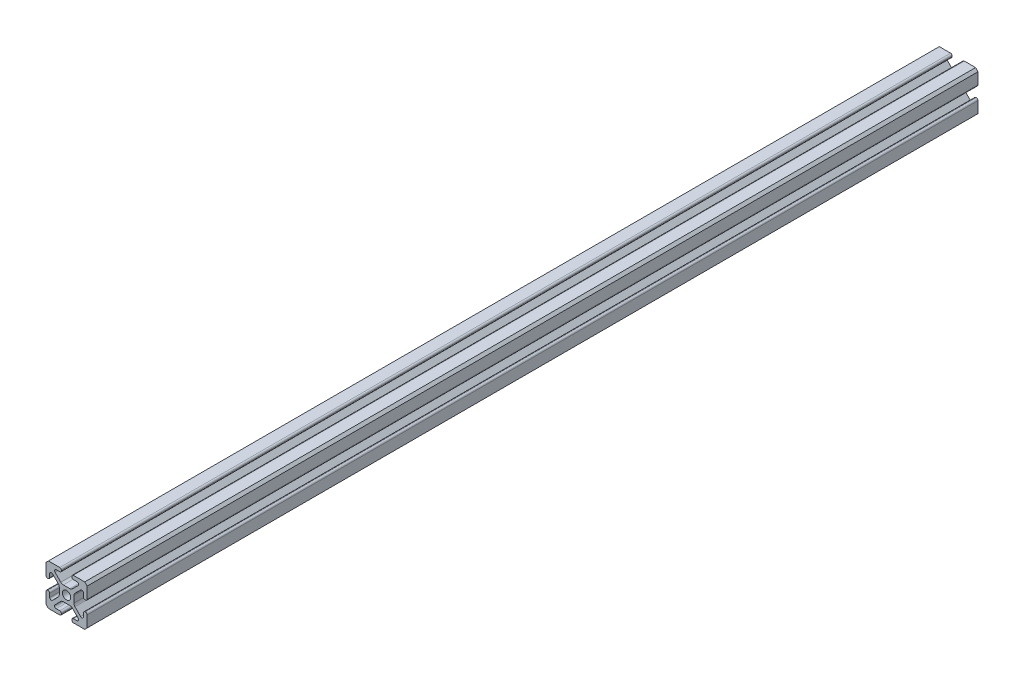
ISO-10303-21;
HEADER;
FILE_DESCRIPTION(('STEP AP214'),'2;1');
FILE_NAME('part.step','',(''),(''),'','','');
FILE_SCHEMA(('AUTOMOTIVE_DESIGN { 1 0 10303 214 1 1 1 1 }'));
ENDSEC;
DATA;
#1=APPLICATION_CONTEXT('core data for automotive mechanical design processes');
#2=APPLICATION_PROTOCOL_DEFINITION('international standard','automotive_design',2000,#1);
#3=PRODUCT_CONTEXT('',#1,'mechanical');
#4=PRODUCT('Part','Part','',(#3));
#5=PRODUCT_RELATED_PRODUCT_CATEGORY('part','',(#4));
#6=PRODUCT_DEFINITION_FORMATION('','',#4);
#7=PRODUCT_DEFINITION_CONTEXT('part definition',#1,'design');
#8=PRODUCT_DEFINITION('design','',#6,#7);
#9=PRODUCT_DEFINITION_SHAPE('','',#8);
#10=(LENGTH_UNIT() NAMED_UNIT(*) SI_UNIT(.MILLI.,.METRE.));
#11=(NAMED_UNIT(*) PLANE_ANGLE_UNIT() SI_UNIT($,.RADIAN.));
#12=(NAMED_UNIT(*) SI_UNIT($,.STERADIAN.) SOLID_ANGLE_UNIT());
#13=UNCERTAINTY_MEASURE_WITH_UNIT(LENGTH_MEASURE(1.E-05),#10,'distance_accuracy_value','');
#14=(GEOMETRIC_REPRESENTATION_CONTEXT(3) GLOBAL_UNCERTAINTY_ASSIGNED_CONTEXT((#13)) GLOBAL_UNIT_ASSIGNED_CONTEXT((#10,
#11,#12)) REPRESENTATION_CONTEXT('',''));
#15=CARTESIAN_POINT('',(0.,0.,0.));
#16=DIRECTION('',(0.,0.,1.));
#17=DIRECTION('',(1.,0.,0.));
#18=AXIS2_PLACEMENT_3D('',#15,#16,#17);
#19=CARTESIAN_POINT('',(-4.22225676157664,-11.684,550.));
#20=DIRECTION('',(0.,0.,1.));
#21=DIRECTION('',(1.,0.,0.));
#22=AXIS2_PLACEMENT_3D('',#19,#20,#21);
#23=PLANE('',#22);
#24=DIRECTION('',(0.707106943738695,-0.707106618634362,0.));
#25=VECTOR('',#24,1.);
#26=CARTESIAN_POINT('',(-12.7,-11.1999522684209,550.));
#27=LINE('',#26,#25);
#28=CARTESIAN_POINT('',(-12.7,-11.1999522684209,550.));
#29=VERTEX_POINT('',#28);
#30=CARTESIAN_POINT('',(-11.1999515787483,-12.7,550.));
#31=VERTEX_POINT('',#30);
#32=EDGE_CURVE('E750',#29,#31,#27,.T.);
#33=ORIENTED_EDGE('',*,*,#32,.T.);
#34=DIRECTION('',(1.,0.,0.));
#35=VECTOR('',#34,1.);
#36=CARTESIAN_POINT('',(-11.1999515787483,-12.7,550.));
#37=LINE('',#36,#35);
#38=CARTESIAN_POINT('',(-4.22225676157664,-12.7,550.));
#39=VERTEX_POINT('',#38);
#40=EDGE_CURVE('E298',#31,#39,#37,.T.);
#41=ORIENTED_EDGE('',*,*,#40,.T.);
#42=CARTESIAN_POINT('',(-4.22225676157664,-11.684,550.));
#43=DIRECTION('',(0.,0.,1.));
#44=DIRECTION('',(1.,0.,0.));
#45=AXIS2_PLACEMENT_3D('',#42,#43,#44);
#46=CIRCLE('',#45,1.016);
#47=CARTESIAN_POINT('',(-3.20625676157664,-11.684,550.));
#48=VERTEX_POINT('',#47);
#49=EDGE_CURVE('E1027',#39,#48,#46,.T.);
#50=ORIENTED_EDGE('',*,*,#49,.T.);
#51=DIRECTION('',(0.,1.,0.));
#52=VECTOR('',#51,1.);
#53=CARTESIAN_POINT('',(-3.20625676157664,-11.684,550.));
#54=LINE('',#53,#52);
#55=CARTESIAN_POINT('',(-3.20625676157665,-11.4406653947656,550.));
#56=VERTEX_POINT('',#55);
#57=EDGE_CURVE('E1047',#48,#56,#54,.T.);
#58=ORIENTED_EDGE('',*,*,#57,.T.);
#59=CARTESIAN_POINT('',(-4.22225676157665,-11.4406653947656,550.));
#60=DIRECTION('',(0.,0.,1.));
#61=DIRECTION('',(1.,0.,0.));
#62=AXIS2_PLACEMENT_3D('',#59,#60,#61);
#63=CIRCLE('',#62,1.016);
#64=CARTESIAN_POINT('',(-4.22225676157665,-10.4246653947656,550.));
#65=VERTEX_POINT('',#64);
#66=EDGE_CURVE('E1043',#56,#65,#63,.T.);
#67=ORIENTED_EDGE('',*,*,#66,.T.);
#68=DIRECTION('',(-1.,0.,0.));
#69=VECTOR('',#68,1.);
#70=CARTESIAN_POINT('',(-4.22225676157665,-10.4246653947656,550.));
#71=LINE('',#70,#69);
#72=CARTESIAN_POINT('',(-6.40926672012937,-10.4246653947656,550.));
#73=VERTEX_POINT('',#72);
#74=EDGE_CURVE('E1046',#65,#73,#71,.T.);
#75=ORIENTED_EDGE('',*,*,#74,.T.);
#76=CARTESIAN_POINT('',(-6.40926672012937,-9.40866539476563,550.));
#77=DIRECTION('',(0.,0.,-1.));
#78=DIRECTION('',(1.,0.,0.));
#79=AXIS2_PLACEMENT_3D('',#76,#77,#78);
#80=CIRCLE('',#79,1.01599999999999);
#81=CARTESIAN_POINT('',(-7.12768717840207,-8.69024487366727,550.));
#82=VERTEX_POINT('',#81);
#83=EDGE_CURVE('E1051',#73,#82,#80,.T.);
#84=ORIENTED_EDGE('',*,*,#83,.T.);
#85=DIRECTION('',(0.707106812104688,0.707106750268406,0.));
#86=VECTOR('',#85,1.);
#87=CARTESIAN_POINT('',(-7.12768717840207,-8.69024487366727,550.));
#88=LINE('',#87,#86);
#89=CARTESIAN_POINT('',(-3.59316669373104,-5.15572469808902,550.));
#90=VERTEX_POINT('',#89);
#91=EDGE_CURVE('E1058',#82,#90,#88,.T.);
#92=ORIENTED_EDGE('',*,*,#91,.T.);
#93=CARTESIAN_POINT('',(-2.03060532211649,-6.71828620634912,550.));
#94=DIRECTION('',(0.,0.,-1.));
#95=DIRECTION('',(1.,0.,0.));
#96=AXIS2_PLACEMENT_3D('',#93,#94,#95);
#97=CIRCLE('',#96,2.2097955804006);
#98=CARTESIAN_POINT('',(-2.03060532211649,-4.50849062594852,550.));
#99=VERTEX_POINT('',#98);
#100=EDGE_CURVE('E1061',#90,#99,#97,.T.);
#101=ORIENTED_EDGE('',*,*,#100,.T.);
#102=DIRECTION('',(1.,0.,0.));
#103=VECTOR('',#102,1.);
#104=CARTESIAN_POINT('',(-2.03060532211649,-4.50849062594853,550.));
#105=LINE('',#104,#103);
#106=CARTESIAN_POINT('',(2.0305988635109,-4.50849062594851,550.));
#107=VERTEX_POINT('',#106);
#108=EDGE_CURVE('E1064',#99,#107,#105,.T.);
#109=ORIENTED_EDGE('',*,*,#108,.T.);
#110=CARTESIAN_POINT('',(2.0305988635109,-6.71828620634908,550.));
#111=DIRECTION('',(0.,0.,-1.));
#112=DIRECTION('',(1.,0.,0.));
#113=AXIS2_PLACEMENT_3D('',#110,#111,#112);
#114=CIRCLE('',#113,2.20979558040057);
#115=CARTESIAN_POINT('',(3.59316031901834,-5.15572478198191,550.));
#116=VERTEX_POINT('',#115);
#117=EDGE_CURVE('E1067',#107,#116,#114,.T.);
#118=ORIENTED_EDGE('',*,*,#117,.T.);
#119=DIRECTION('',(0.707106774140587,-0.707106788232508,0.));
#120=VECTOR('',#119,1.);
#121=CARTESIAN_POINT('',(3.59316031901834,-5.15572478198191,550.));
#122=LINE('',#121,#120);
#123=CARTESIAN_POINT('',(7.12768037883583,-8.6902449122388,550.));
#124=VERTEX_POINT('',#123);
#125=EDGE_CURVE('E1070',#116,#124,#122,.T.);
#126=ORIENTED_EDGE('',*,*,#125,.T.);
#127=CARTESIAN_POINT('',(6.40925988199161,-9.40866539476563,550.));
#128=DIRECTION('',(0.,0.,-1.));
#129=DIRECTION('',(1.,0.,0.));
#130=AXIS2_PLACEMENT_3D('',#127,#128,#129);
#131=CIRCLE('',#130,1.01599999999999);
#132=CARTESIAN_POINT('',(6.40925988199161,-10.4246653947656,550.));
#133=VERTEX_POINT('',#132);
#134=EDGE_CURVE('E1073',#124,#133,#131,.T.);
#135=ORIENTED_EDGE('',*,*,#134,.T.);
#136=DIRECTION('',(-1.,0.,0.));
#137=VECTOR('',#136,1.);
#138=CARTESIAN_POINT('',(6.40925988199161,-10.4246653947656,550.));
#139=LINE('',#138,#137);
#140=CARTESIAN_POINT('',(4.22225064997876,-10.4246653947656,550.));
#141=VERTEX_POINT('',#140);
#142=EDGE_CURVE('E1076',#133,#141,#139,.T.);
#143=ORIENTED_EDGE('',*,*,#142,.T.);
#144=CARTESIAN_POINT('',(4.22225064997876,-11.4406653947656,550.));
#145=DIRECTION('',(0.,0.,1.));
#146=DIRECTION('',(1.,0.,0.));
#147=AXIS2_PLACEMENT_3D('',#144,#145,#146);
#148=CIRCLE('',#147,1.016);
#149=CARTESIAN_POINT('',(3.20625064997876,-11.4406653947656,550.));
#150=VERTEX_POINT('',#149);
#151=EDGE_CURVE('E1079',#141,#150,#148,.T.);
#152=ORIENTED_EDGE('',*,*,#151,.T.);
#153=DIRECTION('',(0.,-1.,0.));
#154=VECTOR('',#153,1.);
#155=CARTESIAN_POINT('',(3.20625064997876,-11.4406653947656,550.));
#156=LINE('',#155,#154);
#157=CARTESIAN_POINT('',(3.20625064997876,-11.684,550.));
#158=VERTEX_POINT('',#157);
#159=EDGE_CURVE('E1082',#150,#158,#156,.T.);
#160=ORIENTED_EDGE('',*,*,#159,.T.);
#161=CARTESIAN_POINT('',(4.22225064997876,-11.684,550.));
#162=DIRECTION('',(0.,0.,1.));
#163=DIRECTION('',(1.,0.,0.));
#164=AXIS2_PLACEMENT_3D('',#161,#162,#163);
#165=CIRCLE('',#164,1.016);
#166=CARTESIAN_POINT('',(4.22225064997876,-12.7,550.));
#167=VERTEX_POINT('',#166);
#168=EDGE_CURVE('E1085',#158,#167,#165,.T.);
#169=ORIENTED_EDGE('',*,*,#168,.T.);
#170=DIRECTION('',(1.,0.,0.));
#171=VECTOR('',#170,1.);
#172=CARTESIAN_POINT('',(4.22225064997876,-12.7,550.));
#173=LINE('',#172,#171);
#174=CARTESIAN_POINT('',(11.1999524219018,-12.7,550.));
#175=VERTEX_POINT('',#174);
#176=EDGE_CURVE('E1088',#167,#175,#173,.T.);
#177=ORIENTED_EDGE('',*,*,#176,.T.);
#178=DIRECTION('',(0.707106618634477,0.70710694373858,0.));
#179=VECTOR('',#178,1.);
#180=CARTESIAN_POINT('',(11.1999524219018,-12.7,550.));
#181=LINE('',#180,#179);
#182=CARTESIAN_POINT('',(12.7,-11.1999517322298,550.));
#183=VERTEX_POINT('',#182);
#184=EDGE_CURVE('E1091',#175,#183,#181,.T.);
#185=ORIENTED_EDGE('',*,*,#184,.T.);
#186=DIRECTION('',(0.,1.,0.));
#187=VECTOR('',#186,1.);
#188=CARTESIAN_POINT('',(12.7,-11.1999517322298,550.));
#189=LINE('',#188,#187);
#190=CARTESIAN_POINT('',(12.7,-4.22225676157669,550.));
#191=VERTEX_POINT('',#190);
#192=EDGE_CURVE('E1094',#183,#191,#189,.T.);
#193=ORIENTED_EDGE('',*,*,#192,.T.);
#194=CARTESIAN_POINT('',(11.684,-4.22225676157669,550.));
#195=DIRECTION('',(0.,0.,1.));
#196=DIRECTION('',(1.,0.,0.));
#197=AXIS2_PLACEMENT_3D('',#194,#195,#196);
#198=CIRCLE('',#197,1.016);
#199=CARTESIAN_POINT('',(11.684,-3.20625676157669,550.));
#200=VERTEX_POINT('',#199);
#201=EDGE_CURVE('E1097',#191,#200,#198,.T.);
#202=ORIENTED_EDGE('',*,*,#201,.T.);
#203=DIRECTION('',(-1.,0.,0.));
#204=VECTOR('',#203,1.);
#205=CARTESIAN_POINT('',(11.684,-3.20625676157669,550.));
#206=LINE('',#205,#204);
#207=CARTESIAN_POINT('',(11.4406653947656,-3.20625676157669,550.));
#208=VERTEX_POINT('',#207);
#209=EDGE_CURVE('E1100',#200,#208,#206,.T.);
#210=ORIENTED_EDGE('',*,*,#209,.T.);
#211=CARTESIAN_POINT('',(11.4406653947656,-4.22225676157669,550.));
#212=DIRECTION('',(0.,0.,1.));
#213=DIRECTION('',(1.,0.,0.));
#214=AXIS2_PLACEMENT_3D('',#211,#212,#213);
#215=CIRCLE('',#214,1.016);
#216=CARTESIAN_POINT('',(10.4246653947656,-4.22225676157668,550.));
#217=VERTEX_POINT('',#216);
#218=EDGE_CURVE('E1103',#208,#217,#215,.T.);
#219=ORIENTED_EDGE('',*,*,#218,.T.);
#220=DIRECTION('',(0.,-1.,0.));
#221=VECTOR('',#220,1.);
#222=CARTESIAN_POINT('',(10.4246653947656,-4.22225676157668,550.));
#223=LINE('',#222,#221);
#224=CARTESIAN_POINT('',(10.4246653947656,-6.40926672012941,550.));
#225=VERTEX_POINT('',#224);
#226=EDGE_CURVE('E1106',#217,#225,#223,.T.);
#227=ORIENTED_EDGE('',*,*,#226,.T.);
#228=CARTESIAN_POINT('',(9.40866539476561,-6.4092667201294,550.));
#229=DIRECTION('',(0.,0.,-1.));
#230=DIRECTION('',(1.,0.,0.));
#231=AXIS2_PLACEMENT_3D('',#228,#229,#230);
#232=CIRCLE('',#231,1.01599999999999);
#233=CARTESIAN_POINT('',(8.69024487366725,-7.12768717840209,550.));
#234=VERTEX_POINT('',#233);
#235=EDGE_CURVE('E1109',#225,#234,#232,.T.);
#236=ORIENTED_EDGE('',*,*,#235,.T.);
#237=DIRECTION('',(-0.707106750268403,0.707106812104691,0.));
#238=VECTOR('',#237,1.);
#239=CARTESIAN_POINT('',(8.69024487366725,-7.1276871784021,550.));
#240=LINE('',#239,#238);
#241=CARTESIAN_POINT('',(5.15572469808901,-3.59316669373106,550.));
#242=VERTEX_POINT('',#241);
#243=EDGE_CURVE('E1112',#234,#242,#240,.T.);
#244=ORIENTED_EDGE('',*,*,#243,.T.);
#245=CARTESIAN_POINT('',(6.71828620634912,-2.03060532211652,550.));
#246=DIRECTION('',(0.,0.,-1.));
#247=DIRECTION('',(1.,0.,0.));
#248=AXIS2_PLACEMENT_3D('',#245,#246,#247);
#249=CIRCLE('',#248,2.2097955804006);
#250=CARTESIAN_POINT('',(4.50849062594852,-2.03060532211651,550.));
#251=VERTEX_POINT('',#250);
#252=EDGE_CURVE('E1115',#242,#251,#249,.T.);
#253=ORIENTED_EDGE('',*,*,#252,.T.);
#254=DIRECTION('',(0.,1.,0.));
#255=VECTOR('',#254,1.);
#256=CARTESIAN_POINT('',(4.50849062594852,-2.03060532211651,550.));
#257=LINE('',#256,#255);
#258=CARTESIAN_POINT('',(4.50849062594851,2.03059886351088,550.));
#259=VERTEX_POINT('',#258);
#260=EDGE_CURVE('E1118',#251,#259,#257,.T.);
#261=ORIENTED_EDGE('',*,*,#260,.T.);
#262=CARTESIAN_POINT('',(6.71828620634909,2.03059886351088,550.));
#263=DIRECTION('',(0.,0.,-1.));
#264=DIRECTION('',(1.,0.,0.));
#265=AXIS2_PLACEMENT_3D('',#262,#263,#264);
#266=CIRCLE('',#265,2.20979558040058);
#267=CARTESIAN_POINT('',(5.15572478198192,3.59316031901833,550.));
#268=VERTEX_POINT('',#267);
#269=EDGE_CURVE('E1121',#259,#268,#266,.T.);
#270=ORIENTED_EDGE('',*,*,#269,.T.);
#271=DIRECTION('',(0.707106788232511,0.707106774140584,0.));
#272=VECTOR('',#271,1.);
#273=CARTESIAN_POINT('',(5.15572478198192,3.59316031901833,550.));
#274=LINE('',#273,#272);
#275=CARTESIAN_POINT('',(8.69024491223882,7.1276803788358,550.));
#276=VERTEX_POINT('',#275);
#277=EDGE_CURVE('E1124',#268,#276,#274,.T.);
#278=ORIENTED_EDGE('',*,*,#277,.T.);
#279=CARTESIAN_POINT('',(9.40866539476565,6.40925988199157,550.));
#280=DIRECTION('',(0.,0.,-1.));
#281=DIRECTION('',(1.,0.,0.));
#282=AXIS2_PLACEMENT_3D('',#279,#280,#281);
#283=CIRCLE('',#282,1.016);
#284=CARTESIAN_POINT('',(10.4246653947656,6.40925988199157,550.));
#285=VERTEX_POINT('',#284);
#286=EDGE_CURVE('E1127',#276,#285,#283,.T.);
#287=ORIENTED_EDGE('',*,*,#286,.T.);
#288=DIRECTION('',(0.,-1.,0.));
#289=VECTOR('',#288,1.);
#290=CARTESIAN_POINT('',(10.4246653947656,6.40925988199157,550.));
#291=LINE('',#290,#289);
#292=CARTESIAN_POINT('',(10.4246653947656,4.22225064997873,550.));
#293=VERTEX_POINT('',#292);
#294=EDGE_CURVE('E1130',#285,#293,#291,.T.);
#295=ORIENTED_EDGE('',*,*,#294,.T.);
#296=CARTESIAN_POINT('',(11.4406653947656,4.22225064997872,550.));
#297=DIRECTION('',(0.,0.,1.));
#298=DIRECTION('',(1.,0.,0.));
#299=AXIS2_PLACEMENT_3D('',#296,#297,#298);
#300=CIRCLE('',#299,1.016);
#301=CARTESIAN_POINT('',(11.4406653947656,3.20625064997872,550.));
#302=VERTEX_POINT('',#301);
#303=EDGE_CURVE('E1133',#293,#302,#300,.T.);
#304=ORIENTED_EDGE('',*,*,#303,.T.);
#305=DIRECTION('',(1.,0.,0.));
#306=VECTOR('',#305,1.);
#307=CARTESIAN_POINT('',(11.4406653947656,3.20625064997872,550.));
#308=LINE('',#307,#306);
#309=CARTESIAN_POINT('',(11.684,3.20625064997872,550.));
#310=VERTEX_POINT('',#309);
#311=EDGE_CURVE('E1136',#302,#310,#308,.T.);
#312=ORIENTED_EDGE('',*,*,#311,.T.);
#313=CARTESIAN_POINT('',(11.684,4.22225064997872,550.));
#314=DIRECTION('',(0.,0.,1.));
#315=DIRECTION('',(1.,0.,0.));
#316=AXIS2_PLACEMENT_3D('',#313,#314,#315);
#317=CIRCLE('',#316,1.016);
#318=CARTESIAN_POINT('',(12.7,4.22225064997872,550.));
#319=VERTEX_POINT('',#318);
#320=EDGE_CURVE('E1139',#310,#319,#317,.T.);
#321=ORIENTED_EDGE('',*,*,#320,.T.);
#322=DIRECTION('',(0.,1.,0.));
#323=VECTOR('',#322,1.);
#324=CARTESIAN_POINT('',(12.7,4.22225064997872,550.));
#325=LINE('',#324,#323);
#326=CARTESIAN_POINT('',(12.7,11.1999547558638,550.));
#327=VERTEX_POINT('',#326);
#328=EDGE_CURVE('E1142',#319,#327,#325,.T.);
#329=ORIENTED_EDGE('',*,*,#328,.T.);
#330=DIRECTION('',(-0.707106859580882,0.707106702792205,0.));
#331=VECTOR('',#330,1.);
#332=CARTESIAN_POINT('',(12.7,11.1999547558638,550.));
#333=LINE('',#332,#331);
#334=CARTESIAN_POINT('',(11.1999544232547,12.7,550.));
#335=VERTEX_POINT('',#334);
#336=EDGE_CURVE('E1145',#327,#335,#333,.T.);
#337=ORIENTED_EDGE('',*,*,#336,.T.);
#338=DIRECTION('',(-1.,0.,0.));
#339=VECTOR('',#338,1.);
#340=CARTESIAN_POINT('',(11.1999544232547,12.7,550.));
#341=LINE('',#340,#339);
#342=CARTESIAN_POINT('',(4.22225676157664,12.7,550.));
#343=VERTEX_POINT('',#342);
#344=EDGE_CURVE('E1148',#335,#343,#341,.T.);
#345=ORIENTED_EDGE('',*,*,#344,.T.);
#346=CARTESIAN_POINT('',(4.22225676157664,11.684,550.));
#347=DIRECTION('',(0.,0.,1.));
#348=DIRECTION('',(1.,0.,0.));
#349=AXIS2_PLACEMENT_3D('',#346,#347,#348);
#350=CIRCLE('',#349,1.016);
#351=CARTESIAN_POINT('',(3.20625676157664,11.684,550.));
#352=VERTEX_POINT('',#351);
#353=EDGE_CURVE('E1151',#343,#352,#350,.T.);
#354=ORIENTED_EDGE('',*,*,#353,.T.);
#355=DIRECTION('',(0.,-1.,0.));
#356=VECTOR('',#355,1.);
#357=CARTESIAN_POINT('',(3.20625676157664,11.684,550.));
#358=LINE('',#357,#356);
#359=CARTESIAN_POINT('',(3.20625676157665,11.4406653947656,550.));
#360=VERTEX_POINT('',#359);
#361=EDGE_CURVE('E1154',#352,#360,#358,.T.);
#362=ORIENTED_EDGE('',*,*,#361,.T.);
#363=CARTESIAN_POINT('',(4.22225676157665,11.4406653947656,550.));
#364=DIRECTION('',(0.,0.,1.));
#365=DIRECTION('',(1.,0.,0.));
#366=AXIS2_PLACEMENT_3D('',#363,#364,#365);
#367=CIRCLE('',#366,1.016);
#368=CARTESIAN_POINT('',(4.22225676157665,10.4246653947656,550.));
#369=VERTEX_POINT('',#368);
#370=EDGE_CURVE('E1157',#360,#369,#367,.T.);
#371=ORIENTED_EDGE('',*,*,#370,.T.);
#372=DIRECTION('',(1.,0.,0.));
#373=VECTOR('',#372,1.);
#374=CARTESIAN_POINT('',(4.22225676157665,10.4246653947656,550.));
#375=LINE('',#374,#373);
#376=CARTESIAN_POINT('',(6.40926672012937,10.4246653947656,550.));
#377=VERTEX_POINT('',#376);
#378=EDGE_CURVE('E1160',#369,#377,#375,.T.);
#379=ORIENTED_EDGE('',*,*,#378,.T.);
#380=CARTESIAN_POINT('',(6.40926672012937,9.40866539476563,550.));
#381=DIRECTION('',(0.,0.,-1.));
#382=DIRECTION('',(1.,0.,0.));
#383=AXIS2_PLACEMENT_3D('',#380,#381,#382);
#384=CIRCLE('',#383,1.01599999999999);
#385=CARTESIAN_POINT('',(7.12768717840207,8.69024487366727,550.));
#386=VERTEX_POINT('',#385);
#387=EDGE_CURVE('E1163',#377,#386,#384,.T.);
#388=ORIENTED_EDGE('',*,*,#387,.T.);
#389=DIRECTION('',(-0.707106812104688,-0.707106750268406,0.));
#390=VECTOR('',#389,1.);
#391=CARTESIAN_POINT('',(7.12768717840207,8.69024487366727,550.));
#392=LINE('',#391,#390);
#393=CARTESIAN_POINT('',(3.59316669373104,5.15572469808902,550.));
#394=VERTEX_POINT('',#393);
#395=EDGE_CURVE('E1166',#386,#394,#392,.T.);
#396=ORIENTED_EDGE('',*,*,#395,.T.);
#397=CARTESIAN_POINT('',(2.03060532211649,6.71828620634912,550.));
#398=DIRECTION('',(0.,0.,-1.));
#399=DIRECTION('',(1.,0.,0.));
#400=AXIS2_PLACEMENT_3D('',#397,#398,#399);
#401=CIRCLE('',#400,2.2097955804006);
#402=CARTESIAN_POINT('',(2.03060532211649,4.50849062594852,550.));
#403=VERTEX_POINT('',#402);
#404=EDGE_CURVE('E1169',#394,#403,#401,.T.);
#405=ORIENTED_EDGE('',*,*,#404,.T.);
#406=DIRECTION('',(-1.,0.,0.));
#407=VECTOR('',#406,1.);
#408=CARTESIAN_POINT('',(2.03060532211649,4.50849062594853,550.));
#409=LINE('',#408,#407);
#410=CARTESIAN_POINT('',(-2.0305988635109,4.50849062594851,550.));
#411=VERTEX_POINT('',#410);
#412=EDGE_CURVE('E1172',#403,#411,#409,.T.);
#413=ORIENTED_EDGE('',*,*,#412,.T.);
#414=CARTESIAN_POINT('',(-2.0305988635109,6.71828620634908,550.));
#415=DIRECTION('',(0.,0.,-1.));
#416=DIRECTION('',(1.,0.,0.));
#417=AXIS2_PLACEMENT_3D('',#414,#415,#416);
#418=CIRCLE('',#417,2.20979558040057);
#419=CARTESIAN_POINT('',(-3.59316031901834,5.15572478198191,550.));
#420=VERTEX_POINT('',#419);
#421=EDGE_CURVE('E1175',#411,#420,#418,.T.);
#422=ORIENTED_EDGE('',*,*,#421,.T.);
#423=DIRECTION('',(-0.707106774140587,0.707106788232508,0.));
#424=VECTOR('',#423,1.);
#425=CARTESIAN_POINT('',(-3.59316031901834,5.15572478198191,550.));
#426=LINE('',#425,#424);
#427=CARTESIAN_POINT('',(-7.12768037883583,8.6902449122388,550.));
#428=VERTEX_POINT('',#427);
#429=EDGE_CURVE('E1178',#420,#428,#426,.T.);
#430=ORIENTED_EDGE('',*,*,#429,.T.);
#431=CARTESIAN_POINT('',(-6.40925988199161,9.40866539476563,550.));
#432=DIRECTION('',(0.,0.,-1.));
#433=DIRECTION('',(1.,0.,0.));
#434=AXIS2_PLACEMENT_3D('',#431,#432,#433);
#435=CIRCLE('',#434,1.01599999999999);
#436=CARTESIAN_POINT('',(-6.40925988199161,10.4246653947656,550.));
#437=VERTEX_POINT('',#436);
#438=EDGE_CURVE('E1181',#428,#437,#435,.T.);
#439=ORIENTED_EDGE('',*,*,#438,.T.);
#440=DIRECTION('',(1.,0.,0.));
#441=VECTOR('',#440,1.);
#442=CARTESIAN_POINT('',(-6.40925988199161,10.4246653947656,550.));
#443=LINE('',#442,#441);
#444=CARTESIAN_POINT('',(-4.22225064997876,10.4246653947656,550.));
#445=VERTEX_POINT('',#444);
#446=EDGE_CURVE('E1184',#437,#445,#443,.T.);
#447=ORIENTED_EDGE('',*,*,#446,.T.);
#448=CARTESIAN_POINT('',(-4.22225064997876,11.4406653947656,550.));
#449=DIRECTION('',(0.,0.,1.));
#450=DIRECTION('',(1.,0.,0.));
#451=AXIS2_PLACEMENT_3D('',#448,#449,#450);
#452=CIRCLE('',#451,1.016);
#453=CARTESIAN_POINT('',(-3.20625064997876,11.4406653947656,550.));
#454=VERTEX_POINT('',#453);
#455=EDGE_CURVE('E1187',#445,#454,#452,.T.);
#456=ORIENTED_EDGE('',*,*,#455,.T.);
#457=DIRECTION('',(0.,1.,0.));
#458=VECTOR('',#457,1.);
#459=CARTESIAN_POINT('',(-3.20625064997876,11.4406653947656,550.));
#460=LINE('',#459,#458);
#461=CARTESIAN_POINT('',(-3.20625064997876,11.684,550.));
#462=VERTEX_POINT('',#461);
#463=EDGE_CURVE('E1190',#454,#462,#460,.T.);
#464=ORIENTED_EDGE('',*,*,#463,.T.);
#465=CARTESIAN_POINT('',(-4.22225064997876,11.684,550.));
#466=DIRECTION('',(0.,0.,1.));
#467=DIRECTION('',(1.,0.,0.));
#468=AXIS2_PLACEMENT_3D('',#465,#466,#467);
#469=CIRCLE('',#468,1.016);
#470=CARTESIAN_POINT('',(-4.22225064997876,12.7,550.));
#471=VERTEX_POINT('',#470);
#472=EDGE_CURVE('E1193',#462,#471,#469,.T.);
#473=ORIENTED_EDGE('',*,*,#472,.T.);
#474=DIRECTION('',(-1.,0.,0.));
#475=VECTOR('',#474,1.);
#476=CARTESIAN_POINT('',(-4.22225064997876,12.7,550.));
#477=LINE('',#476,#475);
#478=CARTESIAN_POINT('',(-11.1999517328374,12.7,550.));
#479=VERTEX_POINT('',#478);
#480=EDGE_CURVE('E1196',#471,#479,#477,.T.);
#481=ORIENTED_EDGE('',*,*,#480,.T.);
#482=DIRECTION('',(-0.707106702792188,-0.707106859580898,0.));
#483=VECTOR('',#482,1.);
#484=CARTESIAN_POINT('',(-11.1999517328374,12.7,550.));
#485=LINE('',#484,#483);
#486=CARTESIAN_POINT('',(-12.7,11.1999514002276,550.));
#487=VERTEX_POINT('',#486);
#488=EDGE_CURVE('E1199',#479,#487,#485,.T.);
#489=ORIENTED_EDGE('',*,*,#488,.T.);
#490=DIRECTION('',(0.,-1.,0.));
#491=VECTOR('',#490,1.);
#492=CARTESIAN_POINT('',(-12.7,11.1999514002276,550.));
#493=LINE('',#492,#491);
#494=CARTESIAN_POINT('',(-12.7,4.22225676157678,550.));
#495=VERTEX_POINT('',#494);
#496=EDGE_CURVE('E1202',#487,#495,#493,.T.);
#497=ORIENTED_EDGE('',*,*,#496,.T.);
#498=CARTESIAN_POINT('',(-11.684,4.22225676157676,550.));
#499=DIRECTION('',(0.,0.,1.));
#500=DIRECTION('',(1.,0.,0.));
#501=AXIS2_PLACEMENT_3D('',#498,#499,#500);
#502=CIRCLE('',#501,1.016);
#503=CARTESIAN_POINT('',(-11.684,3.20625676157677,550.));
#504=VERTEX_POINT('',#503);
#505=EDGE_CURVE('E1205',#495,#504,#502,.T.);
#506=ORIENTED_EDGE('',*,*,#505,.T.);
#507=DIRECTION('',(1.,0.,0.));
#508=VECTOR('',#507,1.);
#509=CARTESIAN_POINT('',(-11.684,3.20625676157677,550.));
#510=LINE('',#509,#508);
#511=CARTESIAN_POINT('',(-11.4406653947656,3.20625676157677,550.));
#512=VERTEX_POINT('',#511);
#513=EDGE_CURVE('E1208',#504,#512,#510,.T.);
#514=ORIENTED_EDGE('',*,*,#513,.T.);
#515=CARTESIAN_POINT('',(-11.4406653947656,4.22225676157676,550.));
#516=DIRECTION('',(0.,0.,1.));
#517=DIRECTION('',(1.,0.,0.));
#518=AXIS2_PLACEMENT_3D('',#515,#516,#517);
#519=CIRCLE('',#518,1.016);
#520=CARTESIAN_POINT('',(-10.4246653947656,4.22225676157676,550.));
#521=VERTEX_POINT('',#520);
#522=EDGE_CURVE('E1211',#512,#521,#519,.T.);
#523=ORIENTED_EDGE('',*,*,#522,.T.);
#524=DIRECTION('',(0.,1.,0.));
#525=VECTOR('',#524,1.);
#526=CARTESIAN_POINT('',(-10.4246653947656,4.22225676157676,550.));
#527=LINE('',#526,#525);
#528=CARTESIAN_POINT('',(-10.4246653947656,6.40926672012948,550.));
#529=VERTEX_POINT('',#528);
#530=EDGE_CURVE('E1214',#521,#529,#527,.T.);
#531=ORIENTED_EDGE('',*,*,#530,.T.);
#532=CARTESIAN_POINT('',(-9.40866539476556,6.40926672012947,550.));
#533=DIRECTION('',(0.,0.,-1.));
#534=DIRECTION('',(1.,0.,0.));
#535=AXIS2_PLACEMENT_3D('',#532,#533,#534);
#536=CIRCLE('',#535,1.016);
#537=CARTESIAN_POINT('',(-8.69024487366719,7.12768717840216,550.));
#538=VERTEX_POINT('',#537);
#539=EDGE_CURVE('E1217',#529,#538,#536,.T.);
#540=ORIENTED_EDGE('',*,*,#539,.T.);
#541=DIRECTION('',(0.707106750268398,-0.707106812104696,0.));
#542=VECTOR('',#541,1.);
#543=CARTESIAN_POINT('',(-8.69024487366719,7.12768717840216,550.));
#544=LINE('',#543,#542);
#545=CARTESIAN_POINT('',(-5.15572469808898,3.5931666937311,550.));
#546=VERTEX_POINT('',#545);
#547=EDGE_CURVE('E1220',#538,#546,#544,.T.);
#548=ORIENTED_EDGE('',*,*,#547,.T.);
#549=CARTESIAN_POINT('',(-6.7182862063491,2.03060532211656,550.));
#550=DIRECTION('',(0.,0.,-1.));
#551=DIRECTION('',(1.,0.,0.));
#552=AXIS2_PLACEMENT_3D('',#549,#550,#551);
#553=CIRCLE('',#552,2.2097955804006);
#554=CARTESIAN_POINT('',(-4.5084906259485,2.03060532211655,550.));
#555=VERTEX_POINT('',#554);
#556=EDGE_CURVE('E1223',#546,#555,#553,.T.);
#557=ORIENTED_EDGE('',*,*,#556,.T.);
#558=DIRECTION('',(0.,-1.,0.));
#559=VECTOR('',#558,1.);
#560=CARTESIAN_POINT('',(-4.5084906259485,2.03060532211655,550.));
#561=LINE('',#560,#559);
#562=CARTESIAN_POINT('',(-4.50849062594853,-2.03059886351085,550.));
#563=VERTEX_POINT('',#562);
#564=EDGE_CURVE('E1226',#555,#563,#561,.T.);
#565=ORIENTED_EDGE('',*,*,#564,.T.);
#566=CARTESIAN_POINT('',(-6.7182862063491,-2.03059886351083,550.));
#567=DIRECTION('',(0.,0.,-1.));
#568=DIRECTION('',(1.,0.,0.));
#569=AXIS2_PLACEMENT_3D('',#566,#567,#568);
#570=CIRCLE('',#569,2.20979558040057);
#571=CARTESIAN_POINT('',(-5.15572478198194,-3.59316031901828,550.));
#572=VERTEX_POINT('',#571);
#573=EDGE_CURVE('E1229',#563,#572,#570,.T.);
#574=ORIENTED_EDGE('',*,*,#573,.T.);
#575=DIRECTION('',(-0.707106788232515,-0.70710677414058,0.));
#576=VECTOR('',#575,1.);
#577=CARTESIAN_POINT('',(-5.15572478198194,-3.59316031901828,550.));
#578=LINE('',#577,#576);
#579=CARTESIAN_POINT('',(-8.69024491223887,-7.12768037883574,550.));
#580=VERTEX_POINT('',#579);
#581=EDGE_CURVE('E1232',#572,#580,#578,.T.);
#582=ORIENTED_EDGE('',*,*,#581,.T.);
#583=CARTESIAN_POINT('',(-9.4086653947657,-6.40925988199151,550.));
#584=DIRECTION('',(0.,0.,-1.));
#585=DIRECTION('',(1.,0.,0.));
#586=AXIS2_PLACEMENT_3D('',#583,#584,#585);
#587=CIRCLE('',#586,1.016);
#588=CARTESIAN_POINT('',(-10.4246653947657,-6.4092598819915,550.));
#589=VERTEX_POINT('',#588);
#590=EDGE_CURVE('E1235',#580,#589,#587,.T.);
#591=ORIENTED_EDGE('',*,*,#590,.T.);
#592=DIRECTION('',(0.,1.,0.));
#593=VECTOR('',#592,1.);
#594=CARTESIAN_POINT('',(-10.4246653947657,-6.4092598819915,550.));
#595=LINE('',#594,#593);
#596=CARTESIAN_POINT('',(-10.4246653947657,-4.22225064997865,550.));
#597=VERTEX_POINT('',#596);
#598=EDGE_CURVE('E1238',#589,#597,#595,.T.);
#599=ORIENTED_EDGE('',*,*,#598,.T.);
#600=CARTESIAN_POINT('',(-11.4406653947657,-4.22225064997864,550.));
#601=DIRECTION('',(0.,0.,1.));
#602=DIRECTION('',(1.,0.,0.));
#603=AXIS2_PLACEMENT_3D('',#600,#601,#602);
#604=CIRCLE('',#603,1.01600000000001);
#605=CARTESIAN_POINT('',(-11.4406653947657,-3.20625064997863,550.));
#606=VERTEX_POINT('',#605);
#607=EDGE_CURVE('E509',#597,#606,#604,.T.);
#608=ORIENTED_EDGE('',*,*,#607,.T.);
#609=DIRECTION('',(-1.,0.,0.));
#610=VECTOR('',#609,1.);
#611=CARTESIAN_POINT('',(-11.4406653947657,-3.20625064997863,550.));
#612=LINE('',#611,#610);
#613=CARTESIAN_POINT('',(-11.684,-3.20625064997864,550.));
#614=VERTEX_POINT('',#613);
#615=EDGE_CURVE('E503',#606,#614,#612,.T.);
#616=ORIENTED_EDGE('',*,*,#615,.T.);
#617=CARTESIAN_POINT('',(-11.684,-4.22225064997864,550.));
#618=DIRECTION('',(0.,0.,1.));
#619=DIRECTION('',(1.,0.,0.));
#620=AXIS2_PLACEMENT_3D('',#617,#618,#619);
#621=CIRCLE('',#620,1.016);
#622=CARTESIAN_POINT('',(-12.7,-4.22225064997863,550.));
#623=VERTEX_POINT('',#622);
#624=EDGE_CURVE('E507',#614,#623,#621,.T.);
#625=ORIENTED_EDGE('',*,*,#624,.T.);
#626=DIRECTION('',(0.,-1.,0.));
#627=VECTOR('',#626,1.);
#628=CARTESIAN_POINT('',(-12.7,-4.22225064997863,550.));
#629=LINE('',#628,#627);
#630=EDGE_CURVE('E63',#623,#29,#629,.T.);
#631=ORIENTED_EDGE('',*,*,#630,.T.);
#632=EDGE_LOOP('',(#33,#41,#50,#58,#67,#75,#84,#92,#101,#109,#118,#126,#135,#143,#152,#160,#169,
#177,#185,#193,#202,#210,#219,#227,#236,#244,#253,#261,#270,#278,#287,#295,#304,#312,#321,#329,
#337,#345,#354,#362,#371,#379,#388,#396,#405,#413,#422,#430,#439,#447,#456,#464,#473,#481,#489,
#497,#506,#514,#523,#531,#540,#548,#557,#565,#574,#582,#591,#599,#608,#616,#625,#631));
#633=FACE_BOUND('',#632,.T.);
#634=CARTESIAN_POINT('',(0.,0.,550.));
#635=DIRECTION('',(0.,0.,1.));
#636=DIRECTION('',(1.,0.,0.));
#637=AXIS2_PLACEMENT_3D('',#634,#635,#636);
#638=CIRCLE('',#637,2.55499488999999);
#639=CARTESIAN_POINT('',(2.55499488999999,0.,550.));
#640=VERTEX_POINT('',#639);
#641=EDGE_CURVE('E536',#640,#640,#638,.T.);
#642=ORIENTED_EDGE('',*,*,#641,.F.);
#643=EDGE_LOOP('',(#642));
#644=FACE_BOUND('',#643,.T.);
#645=ADVANCED_FACE('F45',(#633,#644),#23,.T.);
#646=CARTESIAN_POINT('',(-4.22225676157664,-11.684,0.));
#647=DIRECTION('',(0.,0.,1.));
#648=DIRECTION('',(1.,0.,0.));
#649=AXIS2_PLACEMENT_3D('',#646,#647,#648);
#650=PLANE('',#649);
#651=DIRECTION('',(0.707106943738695,-0.707106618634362,0.));
#652=VECTOR('',#651,1.);
#653=CARTESIAN_POINT('',(-12.7,-11.1999522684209,0.));
#654=LINE('',#653,#652);
#655=CARTESIAN_POINT('',(-12.7,-11.1999522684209,0.));
#656=VERTEX_POINT('',#655);
#657=CARTESIAN_POINT('',(-11.1999515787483,-12.7,0.));
#658=VERTEX_POINT('',#657);
#659=EDGE_CURVE('E531',#656,#658,#654,.T.);
#660=ORIENTED_EDGE('',*,*,#659,.F.);
#661=DIRECTION('',(0.,-1.,0.));
#662=VECTOR('',#661,1.);
#663=CARTESIAN_POINT('',(-12.7,-4.22225064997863,0.));
#664=LINE('',#663,#662);
#665=CARTESIAN_POINT('',(-12.7,-4.22225064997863,0.));
#666=VERTEX_POINT('',#665);
#667=EDGE_CURVE('E290',#666,#656,#664,.T.);
#668=ORIENTED_EDGE('',*,*,#667,.F.);
#669=CARTESIAN_POINT('',(-11.684,-4.22225064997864,0.));
#670=DIRECTION('',(0.,0.,1.));
#671=DIRECTION('',(1.,0.,0.));
#672=AXIS2_PLACEMENT_3D('',#669,#670,#671);
#673=CIRCLE('',#672,1.016);
#674=CARTESIAN_POINT('',(-11.684,-3.20625064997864,0.));
#675=VERTEX_POINT('',#674);
#676=EDGE_CURVE('E284',#675,#666,#673,.T.);
#677=ORIENTED_EDGE('',*,*,#676,.F.);
#678=DIRECTION('',(-1.,0.,0.));
#679=VECTOR('',#678,1.);
#680=CARTESIAN_POINT('',(-11.4406653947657,-3.20625064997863,0.));
#681=LINE('',#680,#679);
#682=CARTESIAN_POINT('',(-11.4406653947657,-3.20625064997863,0.));
#683=VERTEX_POINT('',#682);
#684=EDGE_CURVE('E518',#683,#675,#681,.T.);
#685=ORIENTED_EDGE('',*,*,#684,.F.);
#686=CARTESIAN_POINT('',(-11.4406653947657,-4.22225064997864,0.));
#687=DIRECTION('',(0.,0.,1.));
#688=DIRECTION('',(1.,0.,0.));
#689=AXIS2_PLACEMENT_3D('',#686,#687,#688);
#690=CIRCLE('',#689,1.01600000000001);
#691=CARTESIAN_POINT('',(-10.4246653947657,-4.22225064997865,0.));
#692=VERTEX_POINT('',#691);
#693=EDGE_CURVE('E741',#692,#683,#690,.T.);
#694=ORIENTED_EDGE('',*,*,#693,.F.);
#695=DIRECTION('',(0.,1.,0.));
#696=VECTOR('',#695,1.);
#697=CARTESIAN_POINT('',(-10.4246653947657,-6.4092598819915,0.));
#698=LINE('',#697,#696);
#699=CARTESIAN_POINT('',(-10.4246653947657,-6.4092598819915,0.));
#700=VERTEX_POINT('',#699);
#701=EDGE_CURVE('E738',#700,#692,#698,.T.);
#702=ORIENTED_EDGE('',*,*,#701,.F.);
#703=CARTESIAN_POINT('',(-9.4086653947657,-6.40925988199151,0.));
#704=DIRECTION('',(0.,0.,-1.));
#705=DIRECTION('',(1.,0.,0.));
#706=AXIS2_PLACEMENT_3D('',#703,#704,#705);
#707=CIRCLE('',#706,1.016);
#708=CARTESIAN_POINT('',(-8.69024491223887,-7.12768037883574,0.));
#709=VERTEX_POINT('',#708);
#710=EDGE_CURVE('E735',#709,#700,#707,.T.);
#711=ORIENTED_EDGE('',*,*,#710,.F.);
#712=DIRECTION('',(-0.707106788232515,-0.70710677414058,0.));
#713=VECTOR('',#712,1.);
#714=CARTESIAN_POINT('',(-5.15572478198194,-3.59316031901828,0.));
#715=LINE('',#714,#713);
#716=CARTESIAN_POINT('',(-5.15572478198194,-3.59316031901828,0.));
#717=VERTEX_POINT('',#716);
#718=EDGE_CURVE('E731',#717,#709,#715,.T.);
#719=ORIENTED_EDGE('',*,*,#718,.F.);
#720=CARTESIAN_POINT('',(-6.7182862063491,-2.03059886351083,0.));
#721=DIRECTION('',(0.,0.,-1.));
#722=DIRECTION('',(1.,0.,0.));
#723=AXIS2_PLACEMENT_3D('',#720,#721,#722);
#724=CIRCLE('',#723,2.20979558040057);
#725=CARTESIAN_POINT('',(-4.50849062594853,-2.03059886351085,0.));
#726=VERTEX_POINT('',#725);
#727=EDGE_CURVE('E728',#726,#717,#724,.T.);
#728=ORIENTED_EDGE('',*,*,#727,.F.);
#729=DIRECTION('',(0.,-1.,0.));
#730=VECTOR('',#729,1.);
#731=CARTESIAN_POINT('',(-4.5084906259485,2.03060532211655,0.));
#732=LINE('',#731,#730);
#733=CARTESIAN_POINT('',(-4.5084906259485,2.03060532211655,0.));
#734=VERTEX_POINT('',#733);
#735=EDGE_CURVE('E725',#734,#726,#732,.T.);
#736=ORIENTED_EDGE('',*,*,#735,.F.);
#737=CARTESIAN_POINT('',(-6.7182862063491,2.03060532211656,0.));
#738=DIRECTION('',(0.,0.,-1.));
#739=DIRECTION('',(1.,0.,0.));
#740=AXIS2_PLACEMENT_3D('',#737,#738,#739);
#741=CIRCLE('',#740,2.2097955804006);
#742=CARTESIAN_POINT('',(-5.15572469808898,3.5931666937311,0.));
#743=VERTEX_POINT('',#742);
#744=EDGE_CURVE('E722',#743,#734,#741,.T.);
#745=ORIENTED_EDGE('',*,*,#744,.F.);
#746=DIRECTION('',(0.707106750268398,-0.707106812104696,0.));
#747=VECTOR('',#746,1.);
#748=CARTESIAN_POINT('',(-8.69024487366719,7.12768717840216,0.));
#749=LINE('',#748,#747);
#750=CARTESIAN_POINT('',(-8.69024487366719,7.12768717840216,0.));
#751=VERTEX_POINT('',#750);
#752=EDGE_CURVE('E719',#751,#743,#749,.T.);
#753=ORIENTED_EDGE('',*,*,#752,.F.);
#754=CARTESIAN_POINT('',(-9.40866539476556,6.40926672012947,0.));
#755=DIRECTION('',(0.,0.,-1.));
#756=DIRECTION('',(1.,0.,0.));
#757=AXIS2_PLACEMENT_3D('',#754,#755,#756);
#758=CIRCLE('',#757,1.016);
#759=CARTESIAN_POINT('',(-10.4246653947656,6.40926672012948,0.));
#760=VERTEX_POINT('',#759);
#761=EDGE_CURVE('E716',#760,#751,#758,.T.);
#762=ORIENTED_EDGE('',*,*,#761,.F.);
#763=DIRECTION('',(0.,1.,0.));
#764=VECTOR('',#763,1.);
#765=CARTESIAN_POINT('',(-10.4246653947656,4.22225676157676,0.));
#766=LINE('',#765,#764);
#767=CARTESIAN_POINT('',(-10.4246653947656,4.22225676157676,0.));
#768=VERTEX_POINT('',#767);
#769=EDGE_CURVE('E713',#768,#760,#766,.T.);
#770=ORIENTED_EDGE('',*,*,#769,.F.);
#771=CARTESIAN_POINT('',(-11.4406653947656,4.22225676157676,0.));
#772=DIRECTION('',(0.,0.,1.));
#773=DIRECTION('',(1.,0.,0.));
#774=AXIS2_PLACEMENT_3D('',#771,#772,#773);
#775=CIRCLE('',#774,1.016);
#776=CARTESIAN_POINT('',(-11.4406653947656,3.20625676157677,0.));
#777=VERTEX_POINT('',#776);
#778=EDGE_CURVE('E710',#777,#768,#775,.T.);
#779=ORIENTED_EDGE('',*,*,#778,.F.);
#780=DIRECTION('',(1.,0.,0.));
#781=VECTOR('',#780,1.);
#782=CARTESIAN_POINT('',(-11.684,3.20625676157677,0.));
#783=LINE('',#782,#781);
#784=CARTESIAN_POINT('',(-11.684,3.20625676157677,0.));
#785=VERTEX_POINT('',#784);
#786=EDGE_CURVE('E707',#785,#777,#783,.T.);
#787=ORIENTED_EDGE('',*,*,#786,.F.);
#788=CARTESIAN_POINT('',(-11.684,4.22225676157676,0.));
#789=DIRECTION('',(0.,0.,1.));
#790=DIRECTION('',(1.,0.,0.));
#791=AXIS2_PLACEMENT_3D('',#788,#789,#790);
#792=CIRCLE('',#791,1.016);
#793=CARTESIAN_POINT('',(-12.7,4.22225676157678,0.));
#794=VERTEX_POINT('',#793);
#795=EDGE_CURVE('E704',#794,#785,#792,.T.);
#796=ORIENTED_EDGE('',*,*,#795,.F.);
#797=DIRECTION('',(0.,-1.,0.));
#798=VECTOR('',#797,1.);
#799=CARTESIAN_POINT('',(-12.7,11.1999514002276,0.));
#800=LINE('',#799,#798);
#801=CARTESIAN_POINT('',(-12.7,11.1999514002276,0.));
#802=VERTEX_POINT('',#801);
#803=EDGE_CURVE('E701',#802,#794,#800,.T.);
#804=ORIENTED_EDGE('',*,*,#803,.F.);
#805=DIRECTION('',(-0.707106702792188,-0.707106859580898,0.));
#806=VECTOR('',#805,1.);
#807=CARTESIAN_POINT('',(-11.1999517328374,12.7,0.));
#808=LINE('',#807,#806);
#809=CARTESIAN_POINT('',(-11.1999517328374,12.7,0.));
#810=VERTEX_POINT('',#809);
#811=EDGE_CURVE('E698',#810,#802,#808,.T.);
#812=ORIENTED_EDGE('',*,*,#811,.F.);
#813=DIRECTION('',(-1.,0.,0.));
#814=VECTOR('',#813,1.);
#815=CARTESIAN_POINT('',(-4.22225064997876,12.7,0.));
#816=LINE('',#815,#814);
#817=CARTESIAN_POINT('',(-4.22225064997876,12.7,0.));
#818=VERTEX_POINT('',#817);
#819=EDGE_CURVE('E695',#818,#810,#816,.T.);
#820=ORIENTED_EDGE('',*,*,#819,.F.);
#821=CARTESIAN_POINT('',(-4.22225064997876,11.684,0.));
#822=DIRECTION('',(0.,0.,1.));
#823=DIRECTION('',(1.,0.,0.));
#824=AXIS2_PLACEMENT_3D('',#821,#822,#823);
#825=CIRCLE('',#824,1.016);
#826=CARTESIAN_POINT('',(-3.20625064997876,11.684,0.));
#827=VERTEX_POINT('',#826);
#828=EDGE_CURVE('E692',#827,#818,#825,.T.);
#829=ORIENTED_EDGE('',*,*,#828,.F.);
#830=DIRECTION('',(0.,1.,0.));
#831=VECTOR('',#830,1.);
#832=CARTESIAN_POINT('',(-3.20625064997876,11.4406653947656,0.));
#833=LINE('',#832,#831);
#834=CARTESIAN_POINT('',(-3.20625064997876,11.4406653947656,0.));
#835=VERTEX_POINT('',#834);
#836=EDGE_CURVE('E689',#835,#827,#833,.T.);
#837=ORIENTED_EDGE('',*,*,#836,.F.);
#838=CARTESIAN_POINT('',(-4.22225064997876,11.4406653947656,0.));
#839=DIRECTION('',(0.,0.,1.));
#840=DIRECTION('',(1.,0.,0.));
#841=AXIS2_PLACEMENT_3D('',#838,#839,#840);
#842=CIRCLE('',#841,1.016);
#843=CARTESIAN_POINT('',(-4.22225064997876,10.4246653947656,0.));
#844=VERTEX_POINT('',#843);
#845=EDGE_CURVE('E686',#844,#835,#842,.T.);
#846=ORIENTED_EDGE('',*,*,#845,.F.);
#847=DIRECTION('',(1.,0.,0.));
#848=VECTOR('',#847,1.);
#849=CARTESIAN_POINT('',(-6.40925988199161,10.4246653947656,0.));
#850=LINE('',#849,#848);
#851=CARTESIAN_POINT('',(-6.40925988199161,10.4246653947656,0.));
#852=VERTEX_POINT('',#851);
#853=EDGE_CURVE('E683',#852,#844,#850,.T.);
#854=ORIENTED_EDGE('',*,*,#853,.F.);
#855=CARTESIAN_POINT('',(-6.40925988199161,9.40866539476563,0.));
#856=DIRECTION('',(0.,0.,-1.));
#857=DIRECTION('',(1.,0.,0.));
#858=AXIS2_PLACEMENT_3D('',#855,#856,#857);
#859=CIRCLE('',#858,1.016);
#860=CARTESIAN_POINT('',(-7.12768037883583,8.6902449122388,0.));
#861=VERTEX_POINT('',#860);
#862=EDGE_CURVE('E680',#861,#852,#859,.T.);
#863=ORIENTED_EDGE('',*,*,#862,.F.);
#864=DIRECTION('',(-0.707106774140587,0.707106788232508,0.));
#865=VECTOR('',#864,1.);
#866=CARTESIAN_POINT('',(-3.59316031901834,5.15572478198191,0.));
#867=LINE('',#866,#865);
#868=CARTESIAN_POINT('',(-3.59316031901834,5.15572478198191,0.));
#869=VERTEX_POINT('',#868);
#870=EDGE_CURVE('E676',#869,#861,#867,.T.);
#871=ORIENTED_EDGE('',*,*,#870,.F.);
#872=CARTESIAN_POINT('',(-2.0305988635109,6.71828620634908,0.));
#873=DIRECTION('',(0.,0.,-1.));
#874=DIRECTION('',(1.,0.,0.));
#875=AXIS2_PLACEMENT_3D('',#872,#873,#874);
#876=CIRCLE('',#875,2.20979558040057);
#877=CARTESIAN_POINT('',(-2.0305988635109,4.50849062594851,0.));
#878=VERTEX_POINT('',#877);
#879=EDGE_CURVE('E673',#878,#869,#876,.T.);
#880=ORIENTED_EDGE('',*,*,#879,.F.);
#881=DIRECTION('',(-1.,0.,0.));
#882=VECTOR('',#881,1.);
#883=CARTESIAN_POINT('',(2.03060532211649,4.50849062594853,0.));
#884=LINE('',#883,#882);
#885=CARTESIAN_POINT('',(2.03060532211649,4.50849062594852,0.));
#886=VERTEX_POINT('',#885);
#887=EDGE_CURVE('E670',#886,#878,#884,.T.);
#888=ORIENTED_EDGE('',*,*,#887,.F.);
#889=CARTESIAN_POINT('',(2.03060532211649,6.71828620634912,0.));
#890=DIRECTION('',(0.,0.,-1.));
#891=DIRECTION('',(1.,0.,0.));
#892=AXIS2_PLACEMENT_3D('',#889,#890,#891);
#893=CIRCLE('',#892,2.2097955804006);
#894=CARTESIAN_POINT('',(3.59316669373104,5.15572469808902,0.));
#895=VERTEX_POINT('',#894);
#896=EDGE_CURVE('E667',#895,#886,#893,.T.);
#897=ORIENTED_EDGE('',*,*,#896,.F.);
#898=DIRECTION('',(-0.707106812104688,-0.707106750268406,0.));
#899=VECTOR('',#898,1.);
#900=CARTESIAN_POINT('',(7.12768717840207,8.69024487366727,0.));
#901=LINE('',#900,#899);
#902=CARTESIAN_POINT('',(7.12768717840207,8.69024487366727,0.));
#903=VERTEX_POINT('',#902);
#904=EDGE_CURVE('E664',#903,#895,#901,.T.);
#905=ORIENTED_EDGE('',*,*,#904,.F.);
#906=CARTESIAN_POINT('',(6.40926672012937,9.40866539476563,0.));
#907=DIRECTION('',(0.,0.,-1.));
#908=DIRECTION('',(1.,0.,0.));
#909=AXIS2_PLACEMENT_3D('',#906,#907,#908);
#910=CIRCLE('',#909,1.01599999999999);
#911=CARTESIAN_POINT('',(6.40926672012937,10.4246653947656,0.));
#912=VERTEX_POINT('',#911);
#913=EDGE_CURVE('E661',#912,#903,#910,.T.);
#914=ORIENTED_EDGE('',*,*,#913,.F.);
#915=DIRECTION('',(1.,0.,0.));
#916=VECTOR('',#915,1.);
#917=CARTESIAN_POINT('',(4.22225676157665,10.4246653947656,0.));
#918=LINE('',#917,#916);
#919=CARTESIAN_POINT('',(4.22225676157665,10.4246653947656,0.));
#920=VERTEX_POINT('',#919);
#921=EDGE_CURVE('E658',#920,#912,#918,.T.);
#922=ORIENTED_EDGE('',*,*,#921,.F.);
#923=CARTESIAN_POINT('',(4.22225676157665,11.4406653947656,0.));
#924=DIRECTION('',(0.,0.,1.));
#925=DIRECTION('',(1.,0.,0.));
#926=AXIS2_PLACEMENT_3D('',#923,#924,#925);
#927=CIRCLE('',#926,1.016);
#928=CARTESIAN_POINT('',(3.20625676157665,11.4406653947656,0.));
#929=VERTEX_POINT('',#928);
#930=EDGE_CURVE('E655',#929,#920,#927,.T.);
#931=ORIENTED_EDGE('',*,*,#930,.F.);
#932=DIRECTION('',(0.,-1.,0.));
#933=VECTOR('',#932,1.);
#934=CARTESIAN_POINT('',(3.20625676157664,11.684,0.));
#935=LINE('',#934,#933);
#936=CARTESIAN_POINT('',(3.20625676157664,11.684,0.));
#937=VERTEX_POINT('',#936);
#938=EDGE_CURVE('E652',#937,#929,#935,.T.);
#939=ORIENTED_EDGE('',*,*,#938,.F.);
#940=CARTESIAN_POINT('',(4.22225676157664,11.684,0.));
#941=DIRECTION('',(0.,0.,1.));
#942=DIRECTION('',(1.,0.,0.));
#943=AXIS2_PLACEMENT_3D('',#940,#941,#942);
#944=CIRCLE('',#943,1.016);
#945=CARTESIAN_POINT('',(4.22225676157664,12.7,0.));
#946=VERTEX_POINT('',#945);
#947=EDGE_CURVE('E649',#946,#937,#944,.T.);
#948=ORIENTED_EDGE('',*,*,#947,.F.);
#949=DIRECTION('',(-1.,0.,0.));
#950=VECTOR('',#949,1.);
#951=CARTESIAN_POINT('',(11.1999544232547,12.7,0.));
#952=LINE('',#951,#950);
#953=CARTESIAN_POINT('',(11.1999544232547,12.7,0.));
#954=VERTEX_POINT('',#953);
#955=EDGE_CURVE('E646',#954,#946,#952,.T.);
#956=ORIENTED_EDGE('',*,*,#955,.F.);
#957=DIRECTION('',(-0.707106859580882,0.707106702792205,0.));
#958=VECTOR('',#957,1.);
#959=CARTESIAN_POINT('',(12.7,11.1999547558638,0.));
#960=LINE('',#959,#958);
#961=CARTESIAN_POINT('',(12.7,11.1999547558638,0.));
#962=VERTEX_POINT('',#961);
#963=EDGE_CURVE('E643',#962,#954,#960,.T.);
#964=ORIENTED_EDGE('',*,*,#963,.F.);
#965=DIRECTION('',(0.,1.,0.));
#966=VECTOR('',#965,1.);
#967=CARTESIAN_POINT('',(12.7,4.22225064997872,0.));
#968=LINE('',#967,#966);
#969=CARTESIAN_POINT('',(12.7,4.22225064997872,0.));
#970=VERTEX_POINT('',#969);
#971=EDGE_CURVE('E640',#970,#962,#968,.T.);
#972=ORIENTED_EDGE('',*,*,#971,.F.);
#973=CARTESIAN_POINT('',(11.684,4.22225064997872,0.));
#974=DIRECTION('',(0.,0.,1.));
#975=DIRECTION('',(1.,0.,0.));
#976=AXIS2_PLACEMENT_3D('',#973,#974,#975);
#977=CIRCLE('',#976,1.016);
#978=CARTESIAN_POINT('',(11.684,3.20625064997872,0.));
#979=VERTEX_POINT('',#978);
#980=EDGE_CURVE('E637',#979,#970,#977,.T.);
#981=ORIENTED_EDGE('',*,*,#980,.F.);
#982=DIRECTION('',(1.,0.,0.));
#983=VECTOR('',#982,1.);
#984=CARTESIAN_POINT('',(11.4406653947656,3.20625064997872,0.));
#985=LINE('',#984,#983);
#986=CARTESIAN_POINT('',(11.4406653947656,3.20625064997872,0.));
#987=VERTEX_POINT('',#986);
#988=EDGE_CURVE('E634',#987,#979,#985,.T.);
#989=ORIENTED_EDGE('',*,*,#988,.F.);
#990=CARTESIAN_POINT('',(11.4406653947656,4.22225064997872,0.));
#991=DIRECTION('',(0.,0.,1.));
#992=DIRECTION('',(1.,0.,0.));
#993=AXIS2_PLACEMENT_3D('',#990,#991,#992);
#994=CIRCLE('',#993,1.016);
#995=CARTESIAN_POINT('',(10.4246653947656,4.22225064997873,0.));
#996=VERTEX_POINT('',#995);
#997=EDGE_CURVE('E631',#996,#987,#994,.T.);
#998=ORIENTED_EDGE('',*,*,#997,.F.);
#999=DIRECTION('',(0.,-1.,0.));
#1000=VECTOR('',#999,1.);
#1001=CARTESIAN_POINT('',(10.4246653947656,6.40925988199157,0.));
#1002=LINE('',#1001,#1000);
#1003=CARTESIAN_POINT('',(10.4246653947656,6.40925988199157,0.));
#1004=VERTEX_POINT('',#1003);
#1005=EDGE_CURVE('E628',#1004,#996,#1002,.T.);
#1006=ORIENTED_EDGE('',*,*,#1005,.F.);
#1007=CARTESIAN_POINT('',(9.40866539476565,6.40925988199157,0.));
#1008=DIRECTION('',(0.,0.,-1.));
#1009=DIRECTION('',(1.,0.,0.));
#1010=AXIS2_PLACEMENT_3D('',#1007,#1008,#1009);
#1011=CIRCLE('',#1010,1.016);
#1012=CARTESIAN_POINT('',(8.69024491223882,7.1276803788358,0.));
#1013=VERTEX_POINT('',#1012);
#1014=EDGE_CURVE('E625',#1013,#1004,#1011,.T.);
#1015=ORIENTED_EDGE('',*,*,#1014,.F.);
#1016=DIRECTION('',(0.707106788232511,0.707106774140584,0.));
#1017=VECTOR('',#1016,1.);
#1018=CARTESIAN_POINT('',(5.15572478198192,3.59316031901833,0.));
#1019=LINE('',#1018,#1017);
#1020=CARTESIAN_POINT('',(5.15572478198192,3.59316031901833,0.));
#1021=VERTEX_POINT('',#1020);
#1022=EDGE_CURVE('E621',#1021,#1013,#1019,.T.);
#1023=ORIENTED_EDGE('',*,*,#1022,.F.);
#1024=CARTESIAN_POINT('',(6.71828620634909,2.03059886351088,0.));
#1025=DIRECTION('',(0.,0.,-1.));
#1026=DIRECTION('',(1.,0.,0.));
#1027=AXIS2_PLACEMENT_3D('',#1024,#1025,#1026);
#1028=CIRCLE('',#1027,2.20979558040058);
#1029=CARTESIAN_POINT('',(4.50849062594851,2.03059886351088,0.));
#1030=VERTEX_POINT('',#1029);
#1031=EDGE_CURVE('E618',#1030,#1021,#1028,.T.);
#1032=ORIENTED_EDGE('',*,*,#1031,.F.);
#1033=DIRECTION('',(0.,1.,0.));
#1034=VECTOR('',#1033,1.);
#1035=CARTESIAN_POINT('',(4.50849062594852,-2.03060532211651,0.));
#1036=LINE('',#1035,#1034);
#1037=CARTESIAN_POINT('',(4.50849062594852,-2.03060532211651,0.));
#1038=VERTEX_POINT('',#1037);
#1039=EDGE_CURVE('E615',#1038,#1030,#1036,.T.);
#1040=ORIENTED_EDGE('',*,*,#1039,.F.);
#1041=CARTESIAN_POINT('',(6.71828620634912,-2.03060532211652,0.));
#1042=DIRECTION('',(0.,0.,-1.));
#1043=DIRECTION('',(1.,0.,0.));
#1044=AXIS2_PLACEMENT_3D('',#1041,#1042,#1043);
#1045=CIRCLE('',#1044,2.2097955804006);
#1046=CARTESIAN_POINT('',(5.15572469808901,-3.59316669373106,0.));
#1047=VERTEX_POINT('',#1046);
#1048=EDGE_CURVE('E612',#1047,#1038,#1045,.T.);
#1049=ORIENTED_EDGE('',*,*,#1048,.F.);
#1050=DIRECTION('',(-0.707106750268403,0.707106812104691,0.));
#1051=VECTOR('',#1050,1.);
#1052=CARTESIAN_POINT('',(8.69024487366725,-7.1276871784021,0.));
#1053=LINE('',#1052,#1051);
#1054=CARTESIAN_POINT('',(8.69024487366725,-7.12768717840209,0.));
#1055=VERTEX_POINT('',#1054);
#1056=EDGE_CURVE('E609',#1055,#1047,#1053,.T.);
#1057=ORIENTED_EDGE('',*,*,#1056,.F.);
#1058=CARTESIAN_POINT('',(9.40866539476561,-6.4092667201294,0.));
#1059=DIRECTION('',(0.,0.,-1.));
#1060=DIRECTION('',(1.,0.,0.));
#1061=AXIS2_PLACEMENT_3D('',#1058,#1059,#1060);
#1062=CIRCLE('',#1061,1.01599999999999);
#1063=CARTESIAN_POINT('',(10.4246653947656,-6.40926672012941,0.));
#1064=VERTEX_POINT('',#1063);
#1065=EDGE_CURVE('E606',#1064,#1055,#1062,.T.);
#1066=ORIENTED_EDGE('',*,*,#1065,.F.);
#1067=DIRECTION('',(0.,-1.,0.));
#1068=VECTOR('',#1067,1.);
#1069=CARTESIAN_POINT('',(10.4246653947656,-4.22225676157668,0.));
#1070=LINE('',#1069,#1068);
#1071=CARTESIAN_POINT('',(10.4246653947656,-4.22225676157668,0.));
#1072=VERTEX_POINT('',#1071);
#1073=EDGE_CURVE('E603',#1072,#1064,#1070,.T.);
#1074=ORIENTED_EDGE('',*,*,#1073,.F.);
#1075=CARTESIAN_POINT('',(11.4406653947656,-4.22225676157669,0.));
#1076=DIRECTION('',(0.,0.,1.));
#1077=DIRECTION('',(1.,0.,0.));
#1078=AXIS2_PLACEMENT_3D('',#1075,#1076,#1077);
#1079=CIRCLE('',#1078,1.016);
#1080=CARTESIAN_POINT('',(11.4406653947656,-3.20625676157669,0.));
#1081=VERTEX_POINT('',#1080);
#1082=EDGE_CURVE('E600',#1081,#1072,#1079,.T.);
#1083=ORIENTED_EDGE('',*,*,#1082,.F.);
#1084=DIRECTION('',(-1.,0.,0.));
#1085=VECTOR('',#1084,1.);
#1086=CARTESIAN_POINT('',(11.684,-3.20625676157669,0.));
#1087=LINE('',#1086,#1085);
#1088=CARTESIAN_POINT('',(11.684,-3.20625676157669,0.));
#1089=VERTEX_POINT('',#1088);
#1090=EDGE_CURVE('E597',#1089,#1081,#1087,.T.);
#1091=ORIENTED_EDGE('',*,*,#1090,.F.);
#1092=CARTESIAN_POINT('',(11.684,-4.22225676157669,0.));
#1093=DIRECTION('',(0.,0.,1.));
#1094=DIRECTION('',(1.,0.,0.));
#1095=AXIS2_PLACEMENT_3D('',#1092,#1093,#1094);
#1096=CIRCLE('',#1095,1.016);
#1097=CARTESIAN_POINT('',(12.7,-4.22225676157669,0.));
#1098=VERTEX_POINT('',#1097);
#1099=EDGE_CURVE('E594',#1098,#1089,#1096,.T.);
#1100=ORIENTED_EDGE('',*,*,#1099,.F.);
#1101=DIRECTION('',(0.,1.,0.));
#1102=VECTOR('',#1101,1.);
#1103=CARTESIAN_POINT('',(12.7,-11.1999517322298,0.));
#1104=LINE('',#1103,#1102);
#1105=CARTESIAN_POINT('',(12.7,-11.1999517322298,0.));
#1106=VERTEX_POINT('',#1105);
#1107=EDGE_CURVE('E591',#1106,#1098,#1104,.T.);
#1108=ORIENTED_EDGE('',*,*,#1107,.F.);
#1109=DIRECTION('',(0.707106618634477,0.70710694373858,0.));
#1110=VECTOR('',#1109,1.);
#1111=CARTESIAN_POINT('',(11.1999524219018,-12.7,0.));
#1112=LINE('',#1111,#1110);
#1113=CARTESIAN_POINT('',(11.1999524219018,-12.7,0.));
#1114=VERTEX_POINT('',#1113);
#1115=EDGE_CURVE('E588',#1114,#1106,#1112,.T.);
#1116=ORIENTED_EDGE('',*,*,#1115,.F.);
#1117=DIRECTION('',(1.,0.,0.));
#1118=VECTOR('',#1117,1.);
#1119=CARTESIAN_POINT('',(4.22225064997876,-12.7,0.));
#1120=LINE('',#1119,#1118);
#1121=CARTESIAN_POINT('',(4.22225064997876,-12.7,0.));
#1122=VERTEX_POINT('',#1121);
#1123=EDGE_CURVE('E585',#1122,#1114,#1120,.T.);
#1124=ORIENTED_EDGE('',*,*,#1123,.F.);
#1125=CARTESIAN_POINT('',(4.22225064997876,-11.684,0.));
#1126=DIRECTION('',(0.,0.,1.));
#1127=DIRECTION('',(1.,0.,0.));
#1128=AXIS2_PLACEMENT_3D('',#1125,#1126,#1127);
#1129=CIRCLE('',#1128,1.016);
#1130=CARTESIAN_POINT('',(3.20625064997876,-11.684,0.));
#1131=VERTEX_POINT('',#1130);
#1132=EDGE_CURVE('E582',#1131,#1122,#1129,.T.);
#1133=ORIENTED_EDGE('',*,*,#1132,.F.);
#1134=DIRECTION('',(0.,-1.,0.));
#1135=VECTOR('',#1134,1.);
#1136=CARTESIAN_POINT('',(3.20625064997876,-11.4406653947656,0.));
#1137=LINE('',#1136,#1135);
#1138=CARTESIAN_POINT('',(3.20625064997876,-11.4406653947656,0.));
#1139=VERTEX_POINT('',#1138);
#1140=EDGE_CURVE('E579',#1139,#1131,#1137,.T.);
#1141=ORIENTED_EDGE('',*,*,#1140,.F.);
#1142=CARTESIAN_POINT('',(4.22225064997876,-11.4406653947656,0.));
#1143=DIRECTION('',(0.,0.,1.));
#1144=DIRECTION('',(1.,0.,0.));
#1145=AXIS2_PLACEMENT_3D('',#1142,#1143,#1144);
#1146=CIRCLE('',#1145,1.016);
#1147=CARTESIAN_POINT('',(4.22225064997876,-10.4246653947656,0.));
#1148=VERTEX_POINT('',#1147);
#1149=EDGE_CURVE('E576',#1148,#1139,#1146,.T.);
#1150=ORIENTED_EDGE('',*,*,#1149,.F.);
#1151=DIRECTION('',(-1.,0.,0.));
#1152=VECTOR('',#1151,1.);
#1153=CARTESIAN_POINT('',(6.40925988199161,-10.4246653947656,0.));
#1154=LINE('',#1153,#1152);
#1155=CARTESIAN_POINT('',(6.40925988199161,-10.4246653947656,0.));
#1156=VERTEX_POINT('',#1155);
#1157=EDGE_CURVE('E573',#1156,#1148,#1154,.T.);
#1158=ORIENTED_EDGE('',*,*,#1157,.F.);
#1159=CARTESIAN_POINT('',(6.40925988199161,-9.40866539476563,0.));
#1160=DIRECTION('',(0.,0.,-1.));
#1161=DIRECTION('',(1.,0.,0.));
#1162=AXIS2_PLACEMENT_3D('',#1159,#1160,#1161);
#1163=CIRCLE('',#1162,1.016);
#1164=CARTESIAN_POINT('',(7.12768037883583,-8.6902449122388,0.));
#1165=VERTEX_POINT('',#1164);
#1166=EDGE_CURVE('E570',#1165,#1156,#1163,.T.);
#1167=ORIENTED_EDGE('',*,*,#1166,.F.);
#1168=DIRECTION('',(0.707106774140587,-0.707106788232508,0.));
#1169=VECTOR('',#1168,1.);
#1170=CARTESIAN_POINT('',(3.59316031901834,-5.15572478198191,0.));
#1171=LINE('',#1170,#1169);
#1172=CARTESIAN_POINT('',(3.59316031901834,-5.15572478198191,0.));
#1173=VERTEX_POINT('',#1172);
#1174=EDGE_CURVE('E566',#1173,#1165,#1171,.T.);
#1175=ORIENTED_EDGE('',*,*,#1174,.F.);
#1176=CARTESIAN_POINT('',(2.0305988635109,-6.71828620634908,0.));
#1177=DIRECTION('',(0.,0.,-1.));
#1178=DIRECTION('',(1.,0.,0.));
#1179=AXIS2_PLACEMENT_3D('',#1176,#1177,#1178);
#1180=CIRCLE('',#1179,2.20979558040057);
#1181=CARTESIAN_POINT('',(2.0305988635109,-4.50849062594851,0.));
#1182=VERTEX_POINT('',#1181);
#1183=EDGE_CURVE('E563',#1182,#1173,#1180,.T.);
#1184=ORIENTED_EDGE('',*,*,#1183,.F.);
#1185=DIRECTION('',(1.,0.,0.));
#1186=VECTOR('',#1185,1.);
#1187=CARTESIAN_POINT('',(-2.03060532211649,-4.50849062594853,0.));
#1188=LINE('',#1187,#1186);
#1189=CARTESIAN_POINT('',(-2.03060532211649,-4.50849062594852,0.));
#1190=VERTEX_POINT('',#1189);
#1191=EDGE_CURVE('E560',#1190,#1182,#1188,.T.);
#1192=ORIENTED_EDGE('',*,*,#1191,.F.);
#1193=CARTESIAN_POINT('',(-2.03060532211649,-6.71828620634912,0.));
#1194=DIRECTION('',(0.,0.,-1.));
#1195=DIRECTION('',(1.,0.,0.));
#1196=AXIS2_PLACEMENT_3D('',#1193,#1194,#1195);
#1197=CIRCLE('',#1196,2.2097955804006);
#1198=CARTESIAN_POINT('',(-3.59316669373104,-5.15572469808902,0.));
#1199=VERTEX_POINT('',#1198);
#1200=EDGE_CURVE('E557',#1199,#1190,#1197,.T.);
#1201=ORIENTED_EDGE('',*,*,#1200,.F.);
#1202=DIRECTION('',(0.707106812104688,0.707106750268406,0.));
#1203=VECTOR('',#1202,1.);
#1204=CARTESIAN_POINT('',(-7.12768717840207,-8.69024487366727,0.));
#1205=LINE('',#1204,#1203);
#1206=CARTESIAN_POINT('',(-7.12768717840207,-8.69024487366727,0.));
#1207=VERTEX_POINT('',#1206);
#1208=EDGE_CURVE('E554',#1207,#1199,#1205,.T.);
#1209=ORIENTED_EDGE('',*,*,#1208,.F.);
#1210=CARTESIAN_POINT('',(-6.40926672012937,-9.40866539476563,0.));
#1211=DIRECTION('',(0.,0.,-1.));
#1212=DIRECTION('',(1.,0.,0.));
#1213=AXIS2_PLACEMENT_3D('',#1210,#1211,#1212);
#1214=CIRCLE('',#1213,1.01599999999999);
#1215=CARTESIAN_POINT('',(-6.40926672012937,-10.4246653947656,0.));
#1216=VERTEX_POINT('',#1215);
#1217=EDGE_CURVE('E551',#1216,#1207,#1214,.T.);
#1218=ORIENTED_EDGE('',*,*,#1217,.F.);
#1219=DIRECTION('',(-1.,0.,0.));
#1220=VECTOR('',#1219,1.);
#1221=CARTESIAN_POINT('',(-4.22225676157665,-10.4246653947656,0.));
#1222=LINE('',#1221,#1220);
#1223=CARTESIAN_POINT('',(-4.22225676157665,-10.4246653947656,0.));
#1224=VERTEX_POINT('',#1223);
#1225=EDGE_CURVE('E548',#1224,#1216,#1222,.T.);
#1226=ORIENTED_EDGE('',*,*,#1225,.F.);
#1227=CARTESIAN_POINT('',(-4.22225676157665,-11.4406653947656,0.));
#1228=DIRECTION('',(0.,0.,1.));
#1229=DIRECTION('',(1.,0.,0.));
#1230=AXIS2_PLACEMENT_3D('',#1227,#1228,#1229);
#1231=CIRCLE('',#1230,1.016);
#1232=CARTESIAN_POINT('',(-3.20625676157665,-11.4406653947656,0.));
#1233=VERTEX_POINT('',#1232);
#1234=EDGE_CURVE('E545',#1233,#1224,#1231,.T.);
#1235=ORIENTED_EDGE('',*,*,#1234,.F.);
#1236=DIRECTION('',(0.,1.,0.));
#1237=VECTOR('',#1236,1.);
#1238=CARTESIAN_POINT('',(-3.20625676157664,-11.684,0.));
#1239=LINE('',#1238,#1237);
#1240=CARTESIAN_POINT('',(-3.20625676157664,-11.684,0.));
#1241=VERTEX_POINT('',#1240);
#1242=EDGE_CURVE('E542',#1241,#1233,#1239,.T.);
#1243=ORIENTED_EDGE('',*,*,#1242,.F.);
#1244=CARTESIAN_POINT('',(-4.22225676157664,-11.684,0.));
#1245=DIRECTION('',(0.,0.,1.));
#1246=DIRECTION('',(1.,0.,0.));
#1247=AXIS2_PLACEMENT_3D('',#1244,#1245,#1246);
#1248=CIRCLE('',#1247,1.016);
#1249=CARTESIAN_POINT('',(-4.22225676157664,-12.7,0.));
#1250=VERTEX_POINT('',#1249);
#1251=EDGE_CURVE('E539',#1250,#1241,#1248,.T.);
#1252=ORIENTED_EDGE('',*,*,#1251,.F.);
#1253=DIRECTION('',(1.,0.,0.));
#1254=VECTOR('',#1253,1.);
#1255=CARTESIAN_POINT('',(-11.1999515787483,-12.7,0.));
#1256=LINE('',#1255,#1254);
#1257=EDGE_CURVE('E535',#658,#1250,#1256,.T.);
#1258=ORIENTED_EDGE('',*,*,#1257,.F.);
#1259=EDGE_LOOP('',(#660,#668,#677,#685,#694,#702,#711,#719,#728,#736,#745,#753,#762,#770,#779,
#787,#796,#804,#812,#820,#829,#837,#846,#854,#863,#871,#880,#888,#897,#905,#914,#922,#931,#939,
#948,#956,#964,#972,#981,#989,#998,#1006,#1015,#1023,#1032,#1040,#1049,#1057,#1066,#1074,#1083,
#1091,#1100,#1108,#1116,#1124,#1133,#1141,#1150,#1158,#1167,#1175,#1184,#1192,#1201,#1209,#1218,
#1226,#1235,#1243,#1252,#1258));
#1260=FACE_BOUND('',#1259,.T.);
#1261=CARTESIAN_POINT('',(0.,0.,0.));
#1262=DIRECTION('',(0.,0.,1.));
#1263=DIRECTION('',(1.,0.,0.));
#1264=AXIS2_PLACEMENT_3D('',#1261,#1262,#1263);
#1265=CIRCLE('',#1264,2.55499488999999);
#1266=CARTESIAN_POINT('',(2.55499488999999,0.,0.));
#1267=VERTEX_POINT('',#1266);
#1268=EDGE_CURVE('E2176',#1267,#1267,#1265,.T.);
#1269=ORIENTED_EDGE('',*,*,#1268,.T.);
#1270=EDGE_LOOP('',(#1269));
#1271=FACE_BOUND('',#1270,.T.);
#1272=ADVANCED_FACE('F1031',(#1260,#1271),#650,.F.);
#1273=CARTESIAN_POINT('',(-12.7,-11.1999522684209,550.));
#1274=DIRECTION('',(0.707106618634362,0.707106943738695,0.));
#1275=DIRECTION('',(-0.707106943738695,0.707106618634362,0.));
#1276=AXIS2_PLACEMENT_3D('',#1273,#1274,#1275);
#1277=PLANE('',#1276);
#1278=ORIENTED_EDGE('',*,*,#659,.T.);
#1279=DIRECTION('',(0.,0.,-1.));
#1280=VECTOR('',#1279,1.);
#1281=CARTESIAN_POINT('',(-11.1999515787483,-12.7,550.));
#1282=LINE('',#1281,#1280);
#1283=EDGE_CURVE('E11',#31,#658,#1282,.T.);
#1284=ORIENTED_EDGE('',*,*,#1283,.F.);
#1285=ORIENTED_EDGE('',*,*,#32,.F.);
#1286=DIRECTION('',(0.,0.,-1.));
#1287=VECTOR('',#1286,1.);
#1288=CARTESIAN_POINT('',(-12.7,-11.1999522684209,550.));
#1289=LINE('',#1288,#1287);
#1290=EDGE_CURVE('E527',#29,#656,#1289,.T.);
#1291=ORIENTED_EDGE('',*,*,#1290,.T.);
#1292=EDGE_LOOP('',(#1278,#1284,#1285,#1291));
#1293=FACE_BOUND('',#1292,.T.);
#1294=ADVANCED_FACE('F47',(#1293),#1277,.F.);
#1295=CARTESIAN_POINT('',(-11.1999515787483,-12.7,550.));
#1296=DIRECTION('',(0.,1.,0.));
#1297=DIRECTION('',(0.,0.,1.));
#1298=AXIS2_PLACEMENT_3D('',#1295,#1296,#1297);
#1299=PLANE('',#1298);
#1300=ORIENTED_EDGE('',*,*,#1257,.T.);
#1301=DIRECTION('',(0.,0.,-1.));
#1302=VECTOR('',#1301,1.);
#1303=CARTESIAN_POINT('',(-4.22225676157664,-12.7,550.));
#1304=LINE('',#1303,#1302);
#1305=EDGE_CURVE('E55',#39,#1250,#1304,.T.);
#1306=ORIENTED_EDGE('',*,*,#1305,.F.);
#1307=ORIENTED_EDGE('',*,*,#40,.F.);
#1308=ORIENTED_EDGE('',*,*,#1283,.T.);
#1309=EDGE_LOOP('',(#1300,#1306,#1307,#1308));
#1310=FACE_BOUND('',#1309,.T.);
#1311=ADVANCED_FACE('F1274',(#1310),#1299,.F.);
#1312=CARTESIAN_POINT('',(-4.22225676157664,-11.684,550.));
#1313=DIRECTION('',(0.,0.,-1.));
#1314=DIRECTION('',(-1.,0.,0.));
#1315=AXIS2_PLACEMENT_3D('',#1312,#1313,#1314);
#1316=CYLINDRICAL_SURFACE('',#1315,1.016);
#1317=ORIENTED_EDGE('',*,*,#1251,.T.);
#1318=DIRECTION('',(0.,0.,-1.));
#1319=VECTOR('',#1318,1.);
#1320=CARTESIAN_POINT('',(-3.20625676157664,-11.684,550.));
#1321=LINE('',#1320,#1319);
#1322=EDGE_CURVE('E1017',#48,#1241,#1321,.T.);
#1323=ORIENTED_EDGE('',*,*,#1322,.F.);
#1324=ORIENTED_EDGE('',*,*,#49,.F.);
#1325=ORIENTED_EDGE('',*,*,#1305,.T.);
#1326=EDGE_LOOP('',(#1317,#1323,#1324,#1325));
#1327=FACE_BOUND('',#1326,.T.);
#1328=ADVANCED_FACE('F1025',(#1327),#1316,.T.);
#1329=CARTESIAN_POINT('',(-3.20625676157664,-11.684,550.));
#1330=DIRECTION('',(-1.,0.,0.));
#1331=DIRECTION('',(0.,-1.,0.));
#1332=AXIS2_PLACEMENT_3D('',#1329,#1330,#1331);
#1333=PLANE('',#1332);
#1334=ORIENTED_EDGE('',*,*,#1242,.T.);
#1335=DIRECTION('',(0.,0.,-1.));
#1336=VECTOR('',#1335,1.);
#1337=CARTESIAN_POINT('',(-3.20625676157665,-11.4406653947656,550.));
#1338=LINE('',#1337,#1336);
#1339=EDGE_CURVE('E1013',#56,#1233,#1338,.T.);
#1340=ORIENTED_EDGE('',*,*,#1339,.F.);
#1341=ORIENTED_EDGE('',*,*,#57,.F.);
#1342=ORIENTED_EDGE('',*,*,#1322,.T.);
#1343=EDGE_LOOP('',(#1334,#1340,#1341,#1342));
#1344=FACE_BOUND('',#1343,.T.);
#1345=ADVANCED_FACE('F1037',(#1344),#1333,.F.);
#1346=CARTESIAN_POINT('',(-4.22225676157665,-11.4406653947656,550.));
#1347=DIRECTION('',(0.,0.,-1.));
#1348=DIRECTION('',(-1.,0.,0.));
#1349=AXIS2_PLACEMENT_3D('',#1346,#1347,#1348);
#1350=CYLINDRICAL_SURFACE('',#1349,1.016);
#1351=ORIENTED_EDGE('',*,*,#1234,.T.);
#1352=DIRECTION('',(0.,0.,-1.));
#1353=VECTOR('',#1352,1.);
#1354=CARTESIAN_POINT('',(-4.22225676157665,-10.4246653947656,550.));
#1355=LINE('',#1354,#1353);
#1356=EDGE_CURVE('E1009',#65,#1224,#1355,.T.);
#1357=ORIENTED_EDGE('',*,*,#1356,.F.);
#1358=ORIENTED_EDGE('',*,*,#66,.F.);
#1359=ORIENTED_EDGE('',*,*,#1339,.T.);
#1360=EDGE_LOOP('',(#1351,#1357,#1358,#1359));
#1361=FACE_BOUND('',#1360,.T.);
#1362=ADVANCED_FACE('F1041',(#1361),#1350,.T.);
#1363=CARTESIAN_POINT('',(-4.22225676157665,-10.4246653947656,550.));
#1364=DIRECTION('',(0.,-1.,0.));
#1365=DIRECTION('',(0.,0.,-1.));
#1366=AXIS2_PLACEMENT_3D('',#1363,#1364,#1365);
#1367=PLANE('',#1366);
#1368=ORIENTED_EDGE('',*,*,#1225,.T.);
#1369=DIRECTION('',(0.,0.,-1.));
#1370=VECTOR('',#1369,1.);
#1371=CARTESIAN_POINT('',(-6.40926672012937,-10.4246653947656,550.));
#1372=LINE('',#1371,#1370);
#1373=EDGE_CURVE('E1005',#73,#1216,#1372,.T.);
#1374=ORIENTED_EDGE('',*,*,#1373,.F.);
#1375=ORIENTED_EDGE('',*,*,#74,.F.);
#1376=ORIENTED_EDGE('',*,*,#1356,.T.);
#1377=EDGE_LOOP('',(#1368,#1374,#1375,#1376));
#1378=FACE_BOUND('',#1377,.T.);
#1379=ADVANCED_FACE('F1287',(#1378),#1367,.F.);
#1380=CARTESIAN_POINT('',(-6.40926672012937,-9.40866539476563,550.));
#1381=DIRECTION('',(0.,0.,-1.));
#1382=DIRECTION('',(-1.,0.,0.));
#1383=AXIS2_PLACEMENT_3D('',#1380,#1381,#1382);
#1384=CYLINDRICAL_SURFACE('',#1383,1.01599999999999);
#1385=ORIENTED_EDGE('',*,*,#1217,.T.);
#1386=DIRECTION('',(0.,0.,-1.));
#1387=VECTOR('',#1386,1.);
#1388=CARTESIAN_POINT('',(-7.12768717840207,-8.69024487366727,550.));
#1389=LINE('',#1388,#1387);
#1390=EDGE_CURVE('E1001',#82,#1207,#1389,.T.);
#1391=ORIENTED_EDGE('',*,*,#1390,.F.);
#1392=ORIENTED_EDGE('',*,*,#83,.F.);
#1393=ORIENTED_EDGE('',*,*,#1373,.T.);
#1394=EDGE_LOOP('',(#1385,#1391,#1392,#1393));
#1395=FACE_BOUND('',#1394,.T.);
#1396=ADVANCED_FACE('F1290',(#1395),#1384,.F.);
#1397=CARTESIAN_POINT('',(-7.12768717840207,-8.69024487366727,550.));
#1398=DIRECTION('',(-0.707106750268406,0.707106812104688,0.));
#1399=DIRECTION('',(-0.707106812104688,-0.707106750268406,0.));
#1400=AXIS2_PLACEMENT_3D('',#1397,#1398,#1399);
#1401=PLANE('',#1400);
#1402=ORIENTED_EDGE('',*,*,#1208,.T.);
#1403=DIRECTION('',(0.,0.,-1.));
#1404=VECTOR('',#1403,1.);
#1405=CARTESIAN_POINT('',(-3.59316669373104,-5.15572469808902,550.));
#1406=LINE('',#1405,#1404);
#1407=EDGE_CURVE('E997',#90,#1199,#1406,.T.);
#1408=ORIENTED_EDGE('',*,*,#1407,.F.);
#1409=ORIENTED_EDGE('',*,*,#91,.F.);
#1410=ORIENTED_EDGE('',*,*,#1390,.T.);
#1411=EDGE_LOOP('',(#1402,#1408,#1409,#1410));
#1412=FACE_BOUND('',#1411,.T.);
#1413=ADVANCED_FACE('F1294',(#1412),#1401,.F.);
#1414=CARTESIAN_POINT('',(-2.03060532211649,-6.71828620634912,550.));
#1415=DIRECTION('',(0.,0.,-1.));
#1416=DIRECTION('',(-1.,0.,0.));
#1417=AXIS2_PLACEMENT_3D('',#1414,#1415,#1416);
#1418=CYLINDRICAL_SURFACE('',#1417,2.2097955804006);
#1419=ORIENTED_EDGE('',*,*,#1200,.T.);
#1420=DIRECTION('',(0.,0.,-1.));
#1421=VECTOR('',#1420,1.);
#1422=CARTESIAN_POINT('',(-2.03060532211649,-4.50849062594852,550.));
#1423=LINE('',#1422,#1421);
#1424=EDGE_CURVE('E993',#99,#1190,#1423,.T.);
#1425=ORIENTED_EDGE('',*,*,#1424,.F.);
#1426=ORIENTED_EDGE('',*,*,#100,.F.);
#1427=ORIENTED_EDGE('',*,*,#1407,.T.);
#1428=EDGE_LOOP('',(#1419,#1425,#1426,#1427));
#1429=FACE_BOUND('',#1428,.T.);
#1430=ADVANCED_FACE('F1298',(#1429),#1418,.F.);
#1431=CARTESIAN_POINT('',(-2.03060532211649,-4.50849062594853,550.));
#1432=DIRECTION('',(0.,1.,0.));
#1433=DIRECTION('',(-1.,0.,0.));
#1434=AXIS2_PLACEMENT_3D('',#1431,#1432,#1433);
#1435=PLANE('',#1434);
#1436=ORIENTED_EDGE('',*,*,#1191,.T.);
#1437=DIRECTION('',(0.,0.,-1.));
#1438=VECTOR('',#1437,1.);
#1439=CARTESIAN_POINT('',(2.0305988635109,-4.50849062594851,550.));
#1440=LINE('',#1439,#1438);
#1441=EDGE_CURVE('E989',#107,#1182,#1440,.T.);
#1442=ORIENTED_EDGE('',*,*,#1441,.F.);
#1443=ORIENTED_EDGE('',*,*,#108,.F.);
#1444=ORIENTED_EDGE('',*,*,#1424,.T.);
#1445=EDGE_LOOP('',(#1436,#1442,#1443,#1444));
#1446=FACE_BOUND('',#1445,.T.);
#1447=ADVANCED_FACE('F1302',(#1446),#1435,.F.);
#1448=CARTESIAN_POINT('',(2.0305988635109,-6.71828620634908,550.));
#1449=DIRECTION('',(0.,0.,-1.));
#1450=DIRECTION('',(-1.,0.,0.));
#1451=AXIS2_PLACEMENT_3D('',#1448,#1449,#1450);
#1452=CYLINDRICAL_SURFACE('',#1451,2.20979558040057);
#1453=ORIENTED_EDGE('',*,*,#1183,.T.);
#1454=DIRECTION('',(0.,0.,-1.));
#1455=VECTOR('',#1454,1.);
#1456=CARTESIAN_POINT('',(3.59316031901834,-5.15572478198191,550.));
#1457=LINE('',#1456,#1455);
#1458=EDGE_CURVE('E985',#116,#1173,#1457,.T.);
#1459=ORIENTED_EDGE('',*,*,#1458,.F.);
#1460=ORIENTED_EDGE('',*,*,#117,.F.);
#1461=ORIENTED_EDGE('',*,*,#1441,.T.);
#1462=EDGE_LOOP('',(#1453,#1459,#1460,#1461));
#1463=FACE_BOUND('',#1462,.T.);
#1464=ADVANCED_FACE('F1306',(#1463),#1452,.F.);
#1465=CARTESIAN_POINT('',(3.59316031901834,-5.15572478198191,550.));
#1466=DIRECTION('',(0.707106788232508,0.707106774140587,0.));
#1467=DIRECTION('',(-0.707106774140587,0.707106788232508,0.));
#1468=AXIS2_PLACEMENT_3D('',#1465,#1466,#1467);
#1469=PLANE('',#1468);
#1470=ORIENTED_EDGE('',*,*,#1174,.T.);
#1471=DIRECTION('',(0.,0.,-1.));
#1472=VECTOR('',#1471,1.);
#1473=CARTESIAN_POINT('',(7.12768037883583,-8.6902449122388,550.));
#1474=LINE('',#1473,#1472);
#1475=EDGE_CURVE('E981',#124,#1165,#1474,.T.);
#1476=ORIENTED_EDGE('',*,*,#1475,.F.);
#1477=ORIENTED_EDGE('',*,*,#125,.F.);
#1478=ORIENTED_EDGE('',*,*,#1458,.T.);
#1479=EDGE_LOOP('',(#1470,#1476,#1477,#1478));
#1480=FACE_BOUND('',#1479,.T.);
#1481=ADVANCED_FACE('F1310',(#1480),#1469,.F.);
#1482=CARTESIAN_POINT('',(6.40925988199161,-9.40866539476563,550.));
#1483=DIRECTION('',(0.,0.,-1.));
#1484=DIRECTION('',(-1.,0.,0.));
#1485=AXIS2_PLACEMENT_3D('',#1482,#1483,#1484);
#1486=CYLINDRICAL_SURFACE('',#1485,1.016);
#1487=ORIENTED_EDGE('',*,*,#1166,.T.);
#1488=DIRECTION('',(0.,0.,-1.));
#1489=VECTOR('',#1488,1.);
#1490=CARTESIAN_POINT('',(6.40925988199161,-10.4246653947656,550.));
#1491=LINE('',#1490,#1489);
#1492=EDGE_CURVE('E977',#133,#1156,#1491,.T.);
#1493=ORIENTED_EDGE('',*,*,#1492,.F.);
#1494=ORIENTED_EDGE('',*,*,#134,.F.);
#1495=ORIENTED_EDGE('',*,*,#1475,.T.);
#1496=EDGE_LOOP('',(#1487,#1493,#1494,#1495));
#1497=FACE_BOUND('',#1496,.T.);
#1498=ADVANCED_FACE('F1314',(#1497),#1486,.F.);
#1499=CARTESIAN_POINT('',(6.40925988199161,-10.4246653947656,550.));
#1500=DIRECTION('',(0.,-1.,0.));
#1501=DIRECTION('',(1.,0.,0.));
#1502=AXIS2_PLACEMENT_3D('',#1499,#1500,#1501);
#1503=PLANE('',#1502);
#1504=ORIENTED_EDGE('',*,*,#1157,.T.);
#1505=DIRECTION('',(0.,0.,-1.));
#1506=VECTOR('',#1505,1.);
#1507=CARTESIAN_POINT('',(4.22225064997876,-10.4246653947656,550.));
#1508=LINE('',#1507,#1506);
#1509=EDGE_CURVE('E973',#141,#1148,#1508,.T.);
#1510=ORIENTED_EDGE('',*,*,#1509,.F.);
#1511=ORIENTED_EDGE('',*,*,#142,.F.);
#1512=ORIENTED_EDGE('',*,*,#1492,.T.);
#1513=EDGE_LOOP('',(#1504,#1510,#1511,#1512));
#1514=FACE_BOUND('',#1513,.T.);
#1515=ADVANCED_FACE('F1318',(#1514),#1503,.F.);
#1516=CARTESIAN_POINT('',(4.22225064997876,-11.4406653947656,550.));
#1517=DIRECTION('',(0.,0.,-1.));
#1518=DIRECTION('',(-1.,0.,0.));
#1519=AXIS2_PLACEMENT_3D('',#1516,#1517,#1518);
#1520=CYLINDRICAL_SURFACE('',#1519,1.016);
#1521=ORIENTED_EDGE('',*,*,#1149,.T.);
#1522=DIRECTION('',(0.,0.,-1.));
#1523=VECTOR('',#1522,1.);
#1524=CARTESIAN_POINT('',(3.20625064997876,-11.4406653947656,550.));
#1525=LINE('',#1524,#1523);
#1526=EDGE_CURVE('E969',#150,#1139,#1525,.T.);
#1527=ORIENTED_EDGE('',*,*,#1526,.F.);
#1528=ORIENTED_EDGE('',*,*,#151,.F.);
#1529=ORIENTED_EDGE('',*,*,#1509,.T.);
#1530=EDGE_LOOP('',(#1521,#1527,#1528,#1529));
#1531=FACE_BOUND('',#1530,.T.);
#1532=ADVANCED_FACE('F1322',(#1531),#1520,.T.);
#1533=CARTESIAN_POINT('',(3.20625064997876,-11.4406653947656,550.));
#1534=DIRECTION('',(1.,0.,0.));
#1535=DIRECTION('',(0.,1.,0.));
#1536=AXIS2_PLACEMENT_3D('',#1533,#1534,#1535);
#1537=PLANE('',#1536);
#1538=ORIENTED_EDGE('',*,*,#1140,.T.);
#1539=DIRECTION('',(0.,0.,-1.));
#1540=VECTOR('',#1539,1.);
#1541=CARTESIAN_POINT('',(3.20625064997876,-11.684,550.));
#1542=LINE('',#1541,#1540);
#1543=EDGE_CURVE('E965',#158,#1131,#1542,.T.);
#1544=ORIENTED_EDGE('',*,*,#1543,.F.);
#1545=ORIENTED_EDGE('',*,*,#159,.F.);
#1546=ORIENTED_EDGE('',*,*,#1526,.T.);
#1547=EDGE_LOOP('',(#1538,#1544,#1545,#1546));
#1548=FACE_BOUND('',#1547,.T.);
#1549=ADVANCED_FACE('F1326',(#1548),#1537,.F.);
#1550=CARTESIAN_POINT('',(4.22225064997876,-11.684,550.));
#1551=DIRECTION('',(0.,0.,-1.));
#1552=DIRECTION('',(-1.,0.,0.));
#1553=AXIS2_PLACEMENT_3D('',#1550,#1551,#1552);
#1554=CYLINDRICAL_SURFACE('',#1553,1.016);
#1555=ORIENTED_EDGE('',*,*,#1132,.T.);
#1556=DIRECTION('',(0.,0.,-1.));
#1557=VECTOR('',#1556,1.);
#1558=CARTESIAN_POINT('',(4.22225064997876,-12.7,550.));
#1559=LINE('',#1558,#1557);
#1560=EDGE_CURVE('E961',#167,#1122,#1559,.T.);
#1561=ORIENTED_EDGE('',*,*,#1560,.F.);
#1562=ORIENTED_EDGE('',*,*,#168,.F.);
#1563=ORIENTED_EDGE('',*,*,#1543,.T.);
#1564=EDGE_LOOP('',(#1555,#1561,#1562,#1563));
#1565=FACE_BOUND('',#1564,.T.);
#1566=ADVANCED_FACE('F1330',(#1565),#1554,.T.);
#1567=CARTESIAN_POINT('',(4.22225064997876,-12.7,550.));
#1568=DIRECTION('',(0.,1.,0.));
#1569=DIRECTION('',(0.,0.,1.));
#1570=AXIS2_PLACEMENT_3D('',#1567,#1568,#1569);
#1571=PLANE('',#1570);
#1572=ORIENTED_EDGE('',*,*,#1123,.T.);
#1573=DIRECTION('',(0.,0.,-1.));
#1574=VECTOR('',#1573,1.);
#1575=CARTESIAN_POINT('',(11.1999524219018,-12.7,550.));
#1576=LINE('',#1575,#1574);
#1577=EDGE_CURVE('E957',#175,#1114,#1576,.T.);
#1578=ORIENTED_EDGE('',*,*,#1577,.F.);
#1579=ORIENTED_EDGE('',*,*,#176,.F.);
#1580=ORIENTED_EDGE('',*,*,#1560,.T.);
#1581=EDGE_LOOP('',(#1572,#1578,#1579,#1580));
#1582=FACE_BOUND('',#1581,.T.);
#1583=ADVANCED_FACE('F1334',(#1582),#1571,.F.);
#1584=CARTESIAN_POINT('',(11.1999524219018,-12.7,550.));
#1585=DIRECTION('',(-0.707106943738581,0.707106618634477,0.));
#1586=DIRECTION('',(-0.707106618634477,-0.707106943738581,0.));
#1587=AXIS2_PLACEMENT_3D('',#1584,#1585,#1586);
#1588=PLANE('',#1587);
#1589=ORIENTED_EDGE('',*,*,#1115,.T.);
#1590=DIRECTION('',(0.,0.,-1.));
#1591=VECTOR('',#1590,1.);
#1592=CARTESIAN_POINT('',(12.7,-11.1999517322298,550.));
#1593=LINE('',#1592,#1591);
#1594=EDGE_CURVE('E953',#183,#1106,#1593,.T.);
#1595=ORIENTED_EDGE('',*,*,#1594,.F.);
#1596=ORIENTED_EDGE('',*,*,#184,.F.);
#1597=ORIENTED_EDGE('',*,*,#1577,.T.);
#1598=EDGE_LOOP('',(#1589,#1595,#1596,#1597));
#1599=FACE_BOUND('',#1598,.T.);
#1600=ADVANCED_FACE('F1338',(#1599),#1588,.F.);
#1601=CARTESIAN_POINT('',(12.7,-11.1999517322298,550.));
#1602=DIRECTION('',(-1.,0.,0.));
#1603=DIRECTION('',(0.,0.,1.));
#1604=AXIS2_PLACEMENT_3D('',#1601,#1602,#1603);
#1605=PLANE('',#1604);
#1606=ORIENTED_EDGE('',*,*,#1107,.T.);
#1607=DIRECTION('',(0.,0.,-1.));
#1608=VECTOR('',#1607,1.);
#1609=CARTESIAN_POINT('',(12.7,-4.22225676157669,550.));
#1610=LINE('',#1609,#1608);
#1611=EDGE_CURVE('E949',#191,#1098,#1610,.T.);
#1612=ORIENTED_EDGE('',*,*,#1611,.F.);
#1613=ORIENTED_EDGE('',*,*,#192,.F.);
#1614=ORIENTED_EDGE('',*,*,#1594,.T.);
#1615=EDGE_LOOP('',(#1606,#1612,#1613,#1614));
#1616=FACE_BOUND('',#1615,.T.);
#1617=ADVANCED_FACE('F1342',(#1616),#1605,.F.);
#1618=CARTESIAN_POINT('',(11.684,-4.22225676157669,550.));
#1619=DIRECTION('',(0.,0.,-1.));
#1620=DIRECTION('',(-1.,0.,0.));
#1621=AXIS2_PLACEMENT_3D('',#1618,#1619,#1620);
#1622=CYLINDRICAL_SURFACE('',#1621,1.016);
#1623=ORIENTED_EDGE('',*,*,#1099,.T.);
#1624=DIRECTION('',(0.,0.,-1.));
#1625=VECTOR('',#1624,1.);
#1626=CARTESIAN_POINT('',(11.684,-3.20625676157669,550.));
#1627=LINE('',#1626,#1625);
#1628=EDGE_CURVE('E945',#200,#1089,#1627,.T.);
#1629=ORIENTED_EDGE('',*,*,#1628,.F.);
#1630=ORIENTED_EDGE('',*,*,#201,.F.);
#1631=ORIENTED_EDGE('',*,*,#1611,.T.);
#1632=EDGE_LOOP('',(#1623,#1629,#1630,#1631));
#1633=FACE_BOUND('',#1632,.T.);
#1634=ADVANCED_FACE('F1346',(#1633),#1622,.T.);
#1635=CARTESIAN_POINT('',(11.684,-3.20625676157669,550.));
#1636=DIRECTION('',(0.,-1.,0.));
#1637=DIRECTION('',(1.,0.,0.));
#1638=AXIS2_PLACEMENT_3D('',#1635,#1636,#1637);
#1639=PLANE('',#1638);
#1640=ORIENTED_EDGE('',*,*,#1090,.T.);
#1641=DIRECTION('',(0.,0.,-1.));
#1642=VECTOR('',#1641,1.);
#1643=CARTESIAN_POINT('',(11.4406653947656,-3.20625676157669,550.));
#1644=LINE('',#1643,#1642);
#1645=EDGE_CURVE('E941',#208,#1081,#1644,.T.);
#1646=ORIENTED_EDGE('',*,*,#1645,.F.);
#1647=ORIENTED_EDGE('',*,*,#209,.F.);
#1648=ORIENTED_EDGE('',*,*,#1628,.T.);
#1649=EDGE_LOOP('',(#1640,#1646,#1647,#1648));
#1650=FACE_BOUND('',#1649,.T.);
#1651=ADVANCED_FACE('F1350',(#1650),#1639,.F.);
#1652=CARTESIAN_POINT('',(11.4406653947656,-4.22225676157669,550.));
#1653=DIRECTION('',(0.,0.,-1.));
#1654=DIRECTION('',(-1.,0.,0.));
#1655=AXIS2_PLACEMENT_3D('',#1652,#1653,#1654);
#1656=CYLINDRICAL_SURFACE('',#1655,1.016);
#1657=ORIENTED_EDGE('',*,*,#1082,.T.);
#1658=DIRECTION('',(0.,0.,-1.));
#1659=VECTOR('',#1658,1.);
#1660=CARTESIAN_POINT('',(10.4246653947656,-4.22225676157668,550.));
#1661=LINE('',#1660,#1659);
#1662=EDGE_CURVE('E937',#217,#1072,#1661,.T.);
#1663=ORIENTED_EDGE('',*,*,#1662,.F.);
#1664=ORIENTED_EDGE('',*,*,#218,.F.);
#1665=ORIENTED_EDGE('',*,*,#1645,.T.);
#1666=EDGE_LOOP('',(#1657,#1663,#1664,#1665));
#1667=FACE_BOUND('',#1666,.T.);
#1668=ADVANCED_FACE('F1354',(#1667),#1656,.T.);
#1669=CARTESIAN_POINT('',(10.4246653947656,-4.22225676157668,550.));
#1670=DIRECTION('',(1.,0.,0.));
#1671=DIRECTION('',(0.,1.,0.));
#1672=AXIS2_PLACEMENT_3D('',#1669,#1670,#1671);
#1673=PLANE('',#1672);
#1674=ORIENTED_EDGE('',*,*,#1073,.T.);
#1675=DIRECTION('',(0.,0.,-1.));
#1676=VECTOR('',#1675,1.);
#1677=CARTESIAN_POINT('',(10.4246653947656,-6.40926672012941,550.));
#1678=LINE('',#1677,#1676);
#1679=EDGE_CURVE('E933',#225,#1064,#1678,.T.);
#1680=ORIENTED_EDGE('',*,*,#1679,.F.);
#1681=ORIENTED_EDGE('',*,*,#226,.F.);
#1682=ORIENTED_EDGE('',*,*,#1662,.T.);
#1683=EDGE_LOOP('',(#1674,#1680,#1681,#1682));
#1684=FACE_BOUND('',#1683,.T.);
#1685=ADVANCED_FACE('F1358',(#1684),#1673,.F.);
#1686=CARTESIAN_POINT('',(9.40866539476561,-6.4092667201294,550.));
#1687=DIRECTION('',(0.,0.,-1.));
#1688=DIRECTION('',(-1.,0.,0.));
#1689=AXIS2_PLACEMENT_3D('',#1686,#1687,#1688);
#1690=CYLINDRICAL_SURFACE('',#1689,1.01599999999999);
#1691=ORIENTED_EDGE('',*,*,#1065,.T.);
#1692=DIRECTION('',(0.,0.,-1.));
#1693=VECTOR('',#1692,1.);
#1694=CARTESIAN_POINT('',(8.69024487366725,-7.12768717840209,550.));
#1695=LINE('',#1694,#1693);
#1696=EDGE_CURVE('E929',#234,#1055,#1695,.T.);
#1697=ORIENTED_EDGE('',*,*,#1696,.F.);
#1698=ORIENTED_EDGE('',*,*,#235,.F.);
#1699=ORIENTED_EDGE('',*,*,#1679,.T.);
#1700=EDGE_LOOP('',(#1691,#1697,#1698,#1699));
#1701=FACE_BOUND('',#1700,.T.);
#1702=ADVANCED_FACE('F1362',(#1701),#1690,.F.);
#1703=CARTESIAN_POINT('',(8.69024487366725,-7.1276871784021,550.));
#1704=DIRECTION('',(-0.707106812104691,-0.707106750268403,0.));
#1705=DIRECTION('',(0.707106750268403,-0.707106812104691,0.));
#1706=AXIS2_PLACEMENT_3D('',#1703,#1704,#1705);
#1707=PLANE('',#1706);
#1708=ORIENTED_EDGE('',*,*,#1056,.T.);
#1709=DIRECTION('',(0.,0.,-1.));
#1710=VECTOR('',#1709,1.);
#1711=CARTESIAN_POINT('',(5.15572469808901,-3.59316669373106,550.));
#1712=LINE('',#1711,#1710);
#1713=EDGE_CURVE('E925',#242,#1047,#1712,.T.);
#1714=ORIENTED_EDGE('',*,*,#1713,.F.);
#1715=ORIENTED_EDGE('',*,*,#243,.F.);
#1716=ORIENTED_EDGE('',*,*,#1696,.T.);
#1717=EDGE_LOOP('',(#1708,#1714,#1715,#1716));
#1718=FACE_BOUND('',#1717,.T.);
#1719=ADVANCED_FACE('F1366',(#1718),#1707,.F.);
#1720=CARTESIAN_POINT('',(6.71828620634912,-2.03060532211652,550.));
#1721=DIRECTION('',(0.,0.,-1.));
#1722=DIRECTION('',(-1.,0.,0.));
#1723=AXIS2_PLACEMENT_3D('',#1720,#1721,#1722);
#1724=CYLINDRICAL_SURFACE('',#1723,2.2097955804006);
#1725=ORIENTED_EDGE('',*,*,#1048,.T.);
#1726=DIRECTION('',(0.,0.,-1.));
#1727=VECTOR('',#1726,1.);
#1728=CARTESIAN_POINT('',(4.50849062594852,-2.03060532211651,550.));
#1729=LINE('',#1728,#1727);
#1730=EDGE_CURVE('E921',#251,#1038,#1729,.T.);
#1731=ORIENTED_EDGE('',*,*,#1730,.F.);
#1732=ORIENTED_EDGE('',*,*,#252,.F.);
#1733=ORIENTED_EDGE('',*,*,#1713,.T.);
#1734=EDGE_LOOP('',(#1725,#1731,#1732,#1733));
#1735=FACE_BOUND('',#1734,.T.);
#1736=ADVANCED_FACE('F1370',(#1735),#1724,.F.);
#1737=CARTESIAN_POINT('',(4.50849062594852,-2.03060532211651,550.));
#1738=DIRECTION('',(-1.,0.,0.));
#1739=DIRECTION('',(0.,-1.,0.));
#1740=AXIS2_PLACEMENT_3D('',#1737,#1738,#1739);
#1741=PLANE('',#1740);
#1742=ORIENTED_EDGE('',*,*,#1039,.T.);
#1743=DIRECTION('',(0.,0.,-1.));
#1744=VECTOR('',#1743,1.);
#1745=CARTESIAN_POINT('',(4.50849062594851,2.03059886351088,550.));
#1746=LINE('',#1745,#1744);
#1747=EDGE_CURVE('E917',#259,#1030,#1746,.T.);
#1748=ORIENTED_EDGE('',*,*,#1747,.F.);
#1749=ORIENTED_EDGE('',*,*,#260,.F.);
#1750=ORIENTED_EDGE('',*,*,#1730,.T.);
#1751=EDGE_LOOP('',(#1742,#1748,#1749,#1750));
#1752=FACE_BOUND('',#1751,.T.);
#1753=ADVANCED_FACE('F1374',(#1752),#1741,.F.);
#1754=CARTESIAN_POINT('',(6.71828620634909,2.03059886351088,550.));
#1755=DIRECTION('',(0.,0.,-1.));
#1756=DIRECTION('',(-1.,0.,0.));
#1757=AXIS2_PLACEMENT_3D('',#1754,#1755,#1756);
#1758=CYLINDRICAL_SURFACE('',#1757,2.20979558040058);
#1759=ORIENTED_EDGE('',*,*,#1031,.T.);
#1760=DIRECTION('',(0.,0.,-1.));
#1761=VECTOR('',#1760,1.);
#1762=CARTESIAN_POINT('',(5.15572478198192,3.59316031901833,550.));
#1763=LINE('',#1762,#1761);
#1764=EDGE_CURVE('E913',#268,#1021,#1763,.T.);
#1765=ORIENTED_EDGE('',*,*,#1764,.F.);
#1766=ORIENTED_EDGE('',*,*,#269,.F.);
#1767=ORIENTED_EDGE('',*,*,#1747,.T.);
#1768=EDGE_LOOP('',(#1759,#1765,#1766,#1767));
#1769=FACE_BOUND('',#1768,.T.);
#1770=ADVANCED_FACE('F1378',(#1769),#1758,.F.);
#1771=CARTESIAN_POINT('',(5.15572478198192,3.59316031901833,550.));
#1772=DIRECTION('',(-0.707106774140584,0.707106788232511,0.));
#1773=DIRECTION('',(-0.707106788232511,-0.707106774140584,0.));
#1774=AXIS2_PLACEMENT_3D('',#1771,#1772,#1773);
#1775=PLANE('',#1774);
#1776=ORIENTED_EDGE('',*,*,#1022,.T.);
#1777=DIRECTION('',(0.,0.,-1.));
#1778=VECTOR('',#1777,1.);
#1779=CARTESIAN_POINT('',(8.69024491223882,7.1276803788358,550.));
#1780=LINE('',#1779,#1778);
#1781=EDGE_CURVE('E909',#276,#1013,#1780,.T.);
#1782=ORIENTED_EDGE('',*,*,#1781,.F.);
#1783=ORIENTED_EDGE('',*,*,#277,.F.);
#1784=ORIENTED_EDGE('',*,*,#1764,.T.);
#1785=EDGE_LOOP('',(#1776,#1782,#1783,#1784));
#1786=FACE_BOUND('',#1785,.T.);
#1787=ADVANCED_FACE('F1382',(#1786),#1775,.F.);
#1788=CARTESIAN_POINT('',(9.40866539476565,6.40925988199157,550.));
#1789=DIRECTION('',(0.,0.,-1.));
#1790=DIRECTION('',(-1.,0.,0.));
#1791=AXIS2_PLACEMENT_3D('',#1788,#1789,#1790);
#1792=CYLINDRICAL_SURFACE('',#1791,1.016);
#1793=ORIENTED_EDGE('',*,*,#1014,.T.);
#1794=DIRECTION('',(0.,0.,-1.));
#1795=VECTOR('',#1794,1.);
#1796=CARTESIAN_POINT('',(10.4246653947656,6.40925988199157,550.));
#1797=LINE('',#1796,#1795);
#1798=EDGE_CURVE('E905',#285,#1004,#1797,.T.);
#1799=ORIENTED_EDGE('',*,*,#1798,.F.);
#1800=ORIENTED_EDGE('',*,*,#286,.F.);
#1801=ORIENTED_EDGE('',*,*,#1781,.T.);
#1802=EDGE_LOOP('',(#1793,#1799,#1800,#1801));
#1803=FACE_BOUND('',#1802,.T.);
#1804=ADVANCED_FACE('F1386',(#1803),#1792,.F.);
#1805=CARTESIAN_POINT('',(10.4246653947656,6.40925988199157,550.));
#1806=DIRECTION('',(1.,0.,0.));
#1807=DIRECTION('',(0.,1.,0.));
#1808=AXIS2_PLACEMENT_3D('',#1805,#1806,#1807);
#1809=PLANE('',#1808);
#1810=ORIENTED_EDGE('',*,*,#1005,.T.);
#1811=DIRECTION('',(0.,0.,-1.));
#1812=VECTOR('',#1811,1.);
#1813=CARTESIAN_POINT('',(10.4246653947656,4.22225064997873,550.));
#1814=LINE('',#1813,#1812);
#1815=EDGE_CURVE('E901',#293,#996,#1814,.T.);
#1816=ORIENTED_EDGE('',*,*,#1815,.F.);
#1817=ORIENTED_EDGE('',*,*,#294,.F.);
#1818=ORIENTED_EDGE('',*,*,#1798,.T.);
#1819=EDGE_LOOP('',(#1810,#1816,#1817,#1818));
#1820=FACE_BOUND('',#1819,.T.);
#1821=ADVANCED_FACE('F1390',(#1820),#1809,.F.);
#1822=CARTESIAN_POINT('',(11.4406653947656,4.22225064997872,550.));
#1823=DIRECTION('',(0.,0.,-1.));
#1824=DIRECTION('',(-1.,0.,0.));
#1825=AXIS2_PLACEMENT_3D('',#1822,#1823,#1824);
#1826=CYLINDRICAL_SURFACE('',#1825,1.016);
#1827=ORIENTED_EDGE('',*,*,#997,.T.);
#1828=DIRECTION('',(0.,0.,-1.));
#1829=VECTOR('',#1828,1.);
#1830=CARTESIAN_POINT('',(11.4406653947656,3.20625064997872,550.));
#1831=LINE('',#1830,#1829);
#1832=EDGE_CURVE('E897',#302,#987,#1831,.T.);
#1833=ORIENTED_EDGE('',*,*,#1832,.F.);
#1834=ORIENTED_EDGE('',*,*,#303,.F.);
#1835=ORIENTED_EDGE('',*,*,#1815,.T.);
#1836=EDGE_LOOP('',(#1827,#1833,#1834,#1835));
#1837=FACE_BOUND('',#1836,.T.);
#1838=ADVANCED_FACE('F1394',(#1837),#1826,.T.);
#1839=CARTESIAN_POINT('',(11.4406653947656,3.20625064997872,550.));
#1840=DIRECTION('',(0.,1.,0.));
#1841=DIRECTION('',(-1.,0.,0.));
#1842=AXIS2_PLACEMENT_3D('',#1839,#1840,#1841);
#1843=PLANE('',#1842);
#1844=ORIENTED_EDGE('',*,*,#988,.T.);
#1845=DIRECTION('',(0.,0.,-1.));
#1846=VECTOR('',#1845,1.);
#1847=CARTESIAN_POINT('',(11.684,3.20625064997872,550.));
#1848=LINE('',#1847,#1846);
#1849=EDGE_CURVE('E893',#310,#979,#1848,.T.);
#1850=ORIENTED_EDGE('',*,*,#1849,.F.);
#1851=ORIENTED_EDGE('',*,*,#311,.F.);
#1852=ORIENTED_EDGE('',*,*,#1832,.T.);
#1853=EDGE_LOOP('',(#1844,#1850,#1851,#1852));
#1854=FACE_BOUND('',#1853,.T.);
#1855=ADVANCED_FACE('F1398',(#1854),#1843,.F.);
#1856=CARTESIAN_POINT('',(11.684,4.22225064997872,550.));
#1857=DIRECTION('',(0.,0.,-1.));
#1858=DIRECTION('',(-1.,0.,0.));
#1859=AXIS2_PLACEMENT_3D('',#1856,#1857,#1858);
#1860=CYLINDRICAL_SURFACE('',#1859,1.016);
#1861=ORIENTED_EDGE('',*,*,#980,.T.);
#1862=DIRECTION('',(0.,0.,-1.));
#1863=VECTOR('',#1862,1.);
#1864=CARTESIAN_POINT('',(12.7,4.22225064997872,550.));
#1865=LINE('',#1864,#1863);
#1866=EDGE_CURVE('E889',#319,#970,#1865,.T.);
#1867=ORIENTED_EDGE('',*,*,#1866,.F.);
#1868=ORIENTED_EDGE('',*,*,#320,.F.);
#1869=ORIENTED_EDGE('',*,*,#1849,.T.);
#1870=EDGE_LOOP('',(#1861,#1867,#1868,#1869));
#1871=FACE_BOUND('',#1870,.T.);
#1872=ADVANCED_FACE('F1402',(#1871),#1860,.T.);
#1873=CARTESIAN_POINT('',(12.7,4.22225064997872,550.));
#1874=DIRECTION('',(-1.,0.,0.));
#1875=DIRECTION('',(0.,0.,1.));
#1876=AXIS2_PLACEMENT_3D('',#1873,#1874,#1875);
#1877=PLANE('',#1876);
#1878=ORIENTED_EDGE('',*,*,#971,.T.);
#1879=DIRECTION('',(0.,0.,-1.));
#1880=VECTOR('',#1879,1.);
#1881=CARTESIAN_POINT('',(12.7,11.1999547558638,550.));
#1882=LINE('',#1881,#1880);
#1883=EDGE_CURVE('E885',#327,#962,#1882,.T.);
#1884=ORIENTED_EDGE('',*,*,#1883,.F.);
#1885=ORIENTED_EDGE('',*,*,#328,.F.);
#1886=ORIENTED_EDGE('',*,*,#1866,.T.);
#1887=EDGE_LOOP('',(#1878,#1884,#1885,#1886));
#1888=FACE_BOUND('',#1887,.T.);
#1889=ADVANCED_FACE('F1406',(#1888),#1877,.F.);
#1890=CARTESIAN_POINT('',(12.7,11.1999547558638,550.));
#1891=DIRECTION('',(-0.707106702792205,-0.707106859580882,0.));
#1892=DIRECTION('',(0.707106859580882,-0.707106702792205,0.));
#1893=AXIS2_PLACEMENT_3D('',#1890,#1891,#1892);
#1894=PLANE('',#1893);
#1895=ORIENTED_EDGE('',*,*,#963,.T.);
#1896=DIRECTION('',(0.,0.,-1.));
#1897=VECTOR('',#1896,1.);
#1898=CARTESIAN_POINT('',(11.1999544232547,12.7,550.));
#1899=LINE('',#1898,#1897);
#1900=EDGE_CURVE('E881',#335,#954,#1899,.T.);
#1901=ORIENTED_EDGE('',*,*,#1900,.F.);
#1902=ORIENTED_EDGE('',*,*,#336,.F.);
#1903=ORIENTED_EDGE('',*,*,#1883,.T.);
#1904=EDGE_LOOP('',(#1895,#1901,#1902,#1903));
#1905=FACE_BOUND('',#1904,.T.);
#1906=ADVANCED_FACE('F1410',(#1905),#1894,.F.);
#1907=CARTESIAN_POINT('',(11.1999544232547,12.7,550.));
#1908=DIRECTION('',(0.,-1.,0.));
#1909=DIRECTION('',(0.,0.,-1.));
#1910=AXIS2_PLACEMENT_3D('',#1907,#1908,#1909);
#1911=PLANE('',#1910);
#1912=ORIENTED_EDGE('',*,*,#955,.T.);
#1913=DIRECTION('',(0.,0.,-1.));
#1914=VECTOR('',#1913,1.);
#1915=CARTESIAN_POINT('',(4.22225676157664,12.7,550.));
#1916=LINE('',#1915,#1914);
#1917=EDGE_CURVE('E877',#343,#946,#1916,.T.);
#1918=ORIENTED_EDGE('',*,*,#1917,.F.);
#1919=ORIENTED_EDGE('',*,*,#344,.F.);
#1920=ORIENTED_EDGE('',*,*,#1900,.T.);
#1921=EDGE_LOOP('',(#1912,#1918,#1919,#1920));
#1922=FACE_BOUND('',#1921,.T.);
#1923=ADVANCED_FACE('F1414',(#1922),#1911,.F.);
#1924=CARTESIAN_POINT('',(4.22225676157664,11.684,550.));
#1925=DIRECTION('',(0.,0.,-1.));
#1926=DIRECTION('',(-1.,0.,0.));
#1927=AXIS2_PLACEMENT_3D('',#1924,#1925,#1926);
#1928=CYLINDRICAL_SURFACE('',#1927,1.016);
#1929=ORIENTED_EDGE('',*,*,#947,.T.);
#1930=DIRECTION('',(0.,0.,-1.));
#1931=VECTOR('',#1930,1.);
#1932=CARTESIAN_POINT('',(3.20625676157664,11.684,550.));
#1933=LINE('',#1932,#1931);
#1934=EDGE_CURVE('E873',#352,#937,#1933,.T.);
#1935=ORIENTED_EDGE('',*,*,#1934,.F.);
#1936=ORIENTED_EDGE('',*,*,#353,.F.);
#1937=ORIENTED_EDGE('',*,*,#1917,.T.);
#1938=EDGE_LOOP('',(#1929,#1935,#1936,#1937));
#1939=FACE_BOUND('',#1938,.T.);
#1940=ADVANCED_FACE('F1418',(#1939),#1928,.T.);
#1941=CARTESIAN_POINT('',(3.20625676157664,11.684,550.));
#1942=DIRECTION('',(1.,0.,0.));
#1943=DIRECTION('',(0.,1.,0.));
#1944=AXIS2_PLACEMENT_3D('',#1941,#1942,#1943);
#1945=PLANE('',#1944);
#1946=ORIENTED_EDGE('',*,*,#938,.T.);
#1947=DIRECTION('',(0.,0.,-1.));
#1948=VECTOR('',#1947,1.);
#1949=CARTESIAN_POINT('',(3.20625676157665,11.4406653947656,550.));
#1950=LINE('',#1949,#1948);
#1951=EDGE_CURVE('E869',#360,#929,#1950,.T.);
#1952=ORIENTED_EDGE('',*,*,#1951,.F.);
#1953=ORIENTED_EDGE('',*,*,#361,.F.);
#1954=ORIENTED_EDGE('',*,*,#1934,.T.);
#1955=EDGE_LOOP('',(#1946,#1952,#1953,#1954));
#1956=FACE_BOUND('',#1955,.T.);
#1957=ADVANCED_FACE('F1422',(#1956),#1945,.F.);
#1958=CARTESIAN_POINT('',(4.22225676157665,11.4406653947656,550.));
#1959=DIRECTION('',(0.,0.,-1.));
#1960=DIRECTION('',(-1.,0.,0.));
#1961=AXIS2_PLACEMENT_3D('',#1958,#1959,#1960);
#1962=CYLINDRICAL_SURFACE('',#1961,1.016);
#1963=ORIENTED_EDGE('',*,*,#930,.T.);
#1964=DIRECTION('',(0.,0.,-1.));
#1965=VECTOR('',#1964,1.);
#1966=CARTESIAN_POINT('',(4.22225676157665,10.4246653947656,550.));
#1967=LINE('',#1966,#1965);
#1968=EDGE_CURVE('E865',#369,#920,#1967,.T.);
#1969=ORIENTED_EDGE('',*,*,#1968,.F.);
#1970=ORIENTED_EDGE('',*,*,#370,.F.);
#1971=ORIENTED_EDGE('',*,*,#1951,.T.);
#1972=EDGE_LOOP('',(#1963,#1969,#1970,#1971));
#1973=FACE_BOUND('',#1972,.T.);
#1974=ADVANCED_FACE('F1426',(#1973),#1962,.T.);
#1975=CARTESIAN_POINT('',(4.22225676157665,10.4246653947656,550.));
#1976=DIRECTION('',(0.,1.,0.));
#1977=DIRECTION('',(0.,0.,1.));
#1978=AXIS2_PLACEMENT_3D('',#1975,#1976,#1977);
#1979=PLANE('',#1978);
#1980=ORIENTED_EDGE('',*,*,#921,.T.);
#1981=DIRECTION('',(0.,0.,-1.));
#1982=VECTOR('',#1981,1.);
#1983=CARTESIAN_POINT('',(6.40926672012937,10.4246653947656,550.));
#1984=LINE('',#1983,#1982);
#1985=EDGE_CURVE('E861',#377,#912,#1984,.T.);
#1986=ORIENTED_EDGE('',*,*,#1985,.F.);
#1987=ORIENTED_EDGE('',*,*,#378,.F.);
#1988=ORIENTED_EDGE('',*,*,#1968,.T.);
#1989=EDGE_LOOP('',(#1980,#1986,#1987,#1988));
#1990=FACE_BOUND('',#1989,.T.);
#1991=ADVANCED_FACE('F1430',(#1990),#1979,.F.);
#1992=CARTESIAN_POINT('',(6.40926672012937,9.40866539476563,550.));
#1993=DIRECTION('',(0.,0.,-1.));
#1994=DIRECTION('',(-1.,0.,0.));
#1995=AXIS2_PLACEMENT_3D('',#1992,#1993,#1994);
#1996=CYLINDRICAL_SURFACE('',#1995,1.01599999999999);
#1997=ORIENTED_EDGE('',*,*,#913,.T.);
#1998=DIRECTION('',(0.,0.,-1.));
#1999=VECTOR('',#1998,1.);
#2000=CARTESIAN_POINT('',(7.12768717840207,8.69024487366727,550.));
#2001=LINE('',#2000,#1999);
#2002=EDGE_CURVE('E857',#386,#903,#2001,.T.);
#2003=ORIENTED_EDGE('',*,*,#2002,.F.);
#2004=ORIENTED_EDGE('',*,*,#387,.F.);
#2005=ORIENTED_EDGE('',*,*,#1985,.T.);
#2006=EDGE_LOOP('',(#1997,#2003,#2004,#2005));
#2007=FACE_BOUND('',#2006,.T.);
#2008=ADVANCED_FACE('F1434',(#2007),#1996,.F.);
#2009=CARTESIAN_POINT('',(7.12768717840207,8.69024487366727,550.));
#2010=DIRECTION('',(0.707106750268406,-0.707106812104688,0.));
#2011=DIRECTION('',(0.707106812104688,0.707106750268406,0.));
#2012=AXIS2_PLACEMENT_3D('',#2009,#2010,#2011);
#2013=PLANE('',#2012);
#2014=ORIENTED_EDGE('',*,*,#904,.T.);
#2015=DIRECTION('',(0.,0.,-1.));
#2016=VECTOR('',#2015,1.);
#2017=CARTESIAN_POINT('',(3.59316669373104,5.15572469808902,550.));
#2018=LINE('',#2017,#2016);
#2019=EDGE_CURVE('E853',#394,#895,#2018,.T.);
#2020=ORIENTED_EDGE('',*,*,#2019,.F.);
#2021=ORIENTED_EDGE('',*,*,#395,.F.);
#2022=ORIENTED_EDGE('',*,*,#2002,.T.);
#2023=EDGE_LOOP('',(#2014,#2020,#2021,#2022));
#2024=FACE_BOUND('',#2023,.T.);
#2025=ADVANCED_FACE('F1438',(#2024),#2013,.F.);
#2026=CARTESIAN_POINT('',(2.03060532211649,6.71828620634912,550.));
#2027=DIRECTION('',(0.,0.,-1.));
#2028=DIRECTION('',(-1.,0.,0.));
#2029=AXIS2_PLACEMENT_3D('',#2026,#2027,#2028);
#2030=CYLINDRICAL_SURFACE('',#2029,2.2097955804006);
#2031=ORIENTED_EDGE('',*,*,#896,.T.);
#2032=DIRECTION('',(0.,0.,-1.));
#2033=VECTOR('',#2032,1.);
#2034=CARTESIAN_POINT('',(2.03060532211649,4.50849062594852,550.));
#2035=LINE('',#2034,#2033);
#2036=EDGE_CURVE('E849',#403,#886,#2035,.T.);
#2037=ORIENTED_EDGE('',*,*,#2036,.F.);
#2038=ORIENTED_EDGE('',*,*,#404,.F.);
#2039=ORIENTED_EDGE('',*,*,#2019,.T.);
#2040=EDGE_LOOP('',(#2031,#2037,#2038,#2039));
#2041=FACE_BOUND('',#2040,.T.);
#2042=ADVANCED_FACE('F1442',(#2041),#2030,.F.);
#2043=CARTESIAN_POINT('',(2.03060532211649,4.50849062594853,550.));
#2044=DIRECTION('',(0.,-1.,0.));
#2045=DIRECTION('',(1.,0.,0.));
#2046=AXIS2_PLACEMENT_3D('',#2043,#2044,#2045);
#2047=PLANE('',#2046);
#2048=ORIENTED_EDGE('',*,*,#887,.T.);
#2049=DIRECTION('',(0.,0.,-1.));
#2050=VECTOR('',#2049,1.);
#2051=CARTESIAN_POINT('',(-2.0305988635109,4.50849062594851,550.));
#2052=LINE('',#2051,#2050);
#2053=EDGE_CURVE('E845',#411,#878,#2052,.T.);
#2054=ORIENTED_EDGE('',*,*,#2053,.F.);
#2055=ORIENTED_EDGE('',*,*,#412,.F.);
#2056=ORIENTED_EDGE('',*,*,#2036,.T.);
#2057=EDGE_LOOP('',(#2048,#2054,#2055,#2056));
#2058=FACE_BOUND('',#2057,.T.);
#2059=ADVANCED_FACE('F1446',(#2058),#2047,.F.);
#2060=CARTESIAN_POINT('',(-2.0305988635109,6.71828620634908,550.));
#2061=DIRECTION('',(0.,0.,-1.));
#2062=DIRECTION('',(-1.,0.,0.));
#2063=AXIS2_PLACEMENT_3D('',#2060,#2061,#2062);
#2064=CYLINDRICAL_SURFACE('',#2063,2.20979558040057);
#2065=ORIENTED_EDGE('',*,*,#879,.T.);
#2066=DIRECTION('',(0.,0.,-1.));
#2067=VECTOR('',#2066,1.);
#2068=CARTESIAN_POINT('',(-3.59316031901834,5.15572478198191,550.));
#2069=LINE('',#2068,#2067);
#2070=EDGE_CURVE('E841',#420,#869,#2069,.T.);
#2071=ORIENTED_EDGE('',*,*,#2070,.F.);
#2072=ORIENTED_EDGE('',*,*,#421,.F.);
#2073=ORIENTED_EDGE('',*,*,#2053,.T.);
#2074=EDGE_LOOP('',(#2065,#2071,#2072,#2073));
#2075=FACE_BOUND('',#2074,.T.);
#2076=ADVANCED_FACE('F1450',(#2075),#2064,.F.);
#2077=CARTESIAN_POINT('',(-3.59316031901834,5.15572478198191,550.));
#2078=DIRECTION('',(-0.707106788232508,-0.707106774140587,0.));
#2079=DIRECTION('',(0.707106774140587,-0.707106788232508,0.));
#2080=AXIS2_PLACEMENT_3D('',#2077,#2078,#2079);
#2081=PLANE('',#2080);
#2082=ORIENTED_EDGE('',*,*,#870,.T.);
#2083=DIRECTION('',(0.,0.,-1.));
#2084=VECTOR('',#2083,1.);
#2085=CARTESIAN_POINT('',(-7.12768037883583,8.6902449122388,550.));
#2086=LINE('',#2085,#2084);
#2087=EDGE_CURVE('E837',#428,#861,#2086,.T.);
#2088=ORIENTED_EDGE('',*,*,#2087,.F.);
#2089=ORIENTED_EDGE('',*,*,#429,.F.);
#2090=ORIENTED_EDGE('',*,*,#2070,.T.);
#2091=EDGE_LOOP('',(#2082,#2088,#2089,#2090));
#2092=FACE_BOUND('',#2091,.T.);
#2093=ADVANCED_FACE('F1454',(#2092),#2081,.F.);
#2094=CARTESIAN_POINT('',(-6.40925988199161,9.40866539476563,550.));
#2095=DIRECTION('',(0.,0.,-1.));
#2096=DIRECTION('',(-1.,0.,0.));
#2097=AXIS2_PLACEMENT_3D('',#2094,#2095,#2096);
#2098=CYLINDRICAL_SURFACE('',#2097,1.016);
#2099=ORIENTED_EDGE('',*,*,#862,.T.);
#2100=DIRECTION('',(0.,0.,-1.));
#2101=VECTOR('',#2100,1.);
#2102=CARTESIAN_POINT('',(-6.40925988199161,10.4246653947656,550.));
#2103=LINE('',#2102,#2101);
#2104=EDGE_CURVE('E833',#437,#852,#2103,.T.);
#2105=ORIENTED_EDGE('',*,*,#2104,.F.);
#2106=ORIENTED_EDGE('',*,*,#438,.F.);
#2107=ORIENTED_EDGE('',*,*,#2087,.T.);
#2108=EDGE_LOOP('',(#2099,#2105,#2106,#2107));
#2109=FACE_BOUND('',#2108,.T.);
#2110=ADVANCED_FACE('F1458',(#2109),#2098,.F.);
#2111=CARTESIAN_POINT('',(-6.40925988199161,10.4246653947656,550.));
#2112=DIRECTION('',(0.,1.,0.));
#2113=DIRECTION('',(-1.,0.,0.));
#2114=AXIS2_PLACEMENT_3D('',#2111,#2112,#2113);
#2115=PLANE('',#2114);
#2116=ORIENTED_EDGE('',*,*,#853,.T.);
#2117=DIRECTION('',(0.,0.,-1.));
#2118=VECTOR('',#2117,1.);
#2119=CARTESIAN_POINT('',(-4.22225064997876,10.4246653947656,550.));
#2120=LINE('',#2119,#2118);
#2121=EDGE_CURVE('E829',#445,#844,#2120,.T.);
#2122=ORIENTED_EDGE('',*,*,#2121,.F.);
#2123=ORIENTED_EDGE('',*,*,#446,.F.);
#2124=ORIENTED_EDGE('',*,*,#2104,.T.);
#2125=EDGE_LOOP('',(#2116,#2122,#2123,#2124));
#2126=FACE_BOUND('',#2125,.T.);
#2127=ADVANCED_FACE('F1462',(#2126),#2115,.F.);
#2128=CARTESIAN_POINT('',(-4.22225064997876,11.4406653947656,550.));
#2129=DIRECTION('',(0.,0.,-1.));
#2130=DIRECTION('',(-1.,0.,0.));
#2131=AXIS2_PLACEMENT_3D('',#2128,#2129,#2130);
#2132=CYLINDRICAL_SURFACE('',#2131,1.016);
#2133=ORIENTED_EDGE('',*,*,#845,.T.);
#2134=DIRECTION('',(0.,0.,-1.));
#2135=VECTOR('',#2134,1.);
#2136=CARTESIAN_POINT('',(-3.20625064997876,11.4406653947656,550.));
#2137=LINE('',#2136,#2135);
#2138=EDGE_CURVE('E825',#454,#835,#2137,.T.);
#2139=ORIENTED_EDGE('',*,*,#2138,.F.);
#2140=ORIENTED_EDGE('',*,*,#455,.F.);
#2141=ORIENTED_EDGE('',*,*,#2121,.T.);
#2142=EDGE_LOOP('',(#2133,#2139,#2140,#2141));
#2143=FACE_BOUND('',#2142,.T.);
#2144=ADVANCED_FACE('F1466',(#2143),#2132,.T.);
#2145=CARTESIAN_POINT('',(-3.20625064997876,11.4406653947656,550.));
#2146=DIRECTION('',(-1.,0.,0.));
#2147=DIRECTION('',(0.,-1.,0.));
#2148=AXIS2_PLACEMENT_3D('',#2145,#2146,#2147);
#2149=PLANE('',#2148);
#2150=ORIENTED_EDGE('',*,*,#836,.T.);
#2151=DIRECTION('',(0.,0.,-1.));
#2152=VECTOR('',#2151,1.);
#2153=CARTESIAN_POINT('',(-3.20625064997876,11.684,550.));
#2154=LINE('',#2153,#2152);
#2155=EDGE_CURVE('E821',#462,#827,#2154,.T.);
#2156=ORIENTED_EDGE('',*,*,#2155,.F.);
#2157=ORIENTED_EDGE('',*,*,#463,.F.);
#2158=ORIENTED_EDGE('',*,*,#2138,.T.);
#2159=EDGE_LOOP('',(#2150,#2156,#2157,#2158));
#2160=FACE_BOUND('',#2159,.T.);
#2161=ADVANCED_FACE('F1470',(#2160),#2149,.F.);
#2162=CARTESIAN_POINT('',(-4.22225064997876,11.684,550.));
#2163=DIRECTION('',(0.,0.,-1.));
#2164=DIRECTION('',(-1.,0.,0.));
#2165=AXIS2_PLACEMENT_3D('',#2162,#2163,#2164);
#2166=CYLINDRICAL_SURFACE('',#2165,1.016);
#2167=ORIENTED_EDGE('',*,*,#828,.T.);
#2168=DIRECTION('',(0.,0.,-1.));
#2169=VECTOR('',#2168,1.);
#2170=CARTESIAN_POINT('',(-4.22225064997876,12.7,550.));
#2171=LINE('',#2170,#2169);
#2172=EDGE_CURVE('E817',#471,#818,#2171,.T.);
#2173=ORIENTED_EDGE('',*,*,#2172,.F.);
#2174=ORIENTED_EDGE('',*,*,#472,.F.);
#2175=ORIENTED_EDGE('',*,*,#2155,.T.);
#2176=EDGE_LOOP('',(#2167,#2173,#2174,#2175));
#2177=FACE_BOUND('',#2176,.T.);
#2178=ADVANCED_FACE('F1474',(#2177),#2166,.T.);
#2179=CARTESIAN_POINT('',(-4.22225064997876,12.7,550.));
#2180=DIRECTION('',(0.,-1.,0.));
#2181=DIRECTION('',(0.,0.,-1.));
#2182=AXIS2_PLACEMENT_3D('',#2179,#2180,#2181);
#2183=PLANE('',#2182);
#2184=ORIENTED_EDGE('',*,*,#819,.T.);
#2185=DIRECTION('',(0.,0.,-1.));
#2186=VECTOR('',#2185,1.);
#2187=CARTESIAN_POINT('',(-11.1999517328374,12.7,550.));
#2188=LINE('',#2187,#2186);
#2189=EDGE_CURVE('E813',#479,#810,#2188,.T.);
#2190=ORIENTED_EDGE('',*,*,#2189,.F.);
#2191=ORIENTED_EDGE('',*,*,#480,.F.);
#2192=ORIENTED_EDGE('',*,*,#2172,.T.);
#2193=EDGE_LOOP('',(#2184,#2190,#2191,#2192));
#2194=FACE_BOUND('',#2193,.T.);
#2195=ADVANCED_FACE('F1478',(#2194),#2183,.F.);
#2196=CARTESIAN_POINT('',(-11.1999517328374,12.7,550.));
#2197=DIRECTION('',(0.707106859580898,-0.707106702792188,0.));
#2198=DIRECTION('',(0.707106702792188,0.707106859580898,0.));
#2199=AXIS2_PLACEMENT_3D('',#2196,#2197,#2198);
#2200=PLANE('',#2199);
#2201=ORIENTED_EDGE('',*,*,#811,.T.);
#2202=DIRECTION('',(0.,0.,-1.));
#2203=VECTOR('',#2202,1.);
#2204=CARTESIAN_POINT('',(-12.7,11.1999514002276,550.));
#2205=LINE('',#2204,#2203);
#2206=EDGE_CURVE('E809',#487,#802,#2205,.T.);
#2207=ORIENTED_EDGE('',*,*,#2206,.F.);
#2208=ORIENTED_EDGE('',*,*,#488,.F.);
#2209=ORIENTED_EDGE('',*,*,#2189,.T.);
#2210=EDGE_LOOP('',(#2201,#2207,#2208,#2209));
#2211=FACE_BOUND('',#2210,.T.);
#2212=ADVANCED_FACE('F1482',(#2211),#2200,.F.);
#2213=CARTESIAN_POINT('',(-12.7,11.1999514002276,550.));
#2214=DIRECTION('',(1.,0.,0.));
#2215=DIRECTION('',(0.,0.,-1.));
#2216=AXIS2_PLACEMENT_3D('',#2213,#2214,#2215);
#2217=PLANE('',#2216);
#2218=ORIENTED_EDGE('',*,*,#803,.T.);
#2219=DIRECTION('',(0.,0.,-1.));
#2220=VECTOR('',#2219,1.);
#2221=CARTESIAN_POINT('',(-12.7,4.22225676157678,550.));
#2222=LINE('',#2221,#2220);
#2223=EDGE_CURVE('E805',#495,#794,#2222,.T.);
#2224=ORIENTED_EDGE('',*,*,#2223,.F.);
#2225=ORIENTED_EDGE('',*,*,#496,.F.);
#2226=ORIENTED_EDGE('',*,*,#2206,.T.);
#2227=EDGE_LOOP('',(#2218,#2224,#2225,#2226));
#2228=FACE_BOUND('',#2227,.T.);
#2229=ADVANCED_FACE('F1486',(#2228),#2217,.F.);
#2230=CARTESIAN_POINT('',(-11.684,4.22225676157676,550.));
#2231=DIRECTION('',(0.,0.,-1.));
#2232=DIRECTION('',(-1.,0.,0.));
#2233=AXIS2_PLACEMENT_3D('',#2230,#2231,#2232);
#2234=CYLINDRICAL_SURFACE('',#2233,1.016);
#2235=ORIENTED_EDGE('',*,*,#795,.T.);
#2236=DIRECTION('',(0.,0.,-1.));
#2237=VECTOR('',#2236,1.);
#2238=CARTESIAN_POINT('',(-11.684,3.20625676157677,550.));
#2239=LINE('',#2238,#2237);
#2240=EDGE_CURVE('E801',#504,#785,#2239,.T.);
#2241=ORIENTED_EDGE('',*,*,#2240,.F.);
#2242=ORIENTED_EDGE('',*,*,#505,.F.);
#2243=ORIENTED_EDGE('',*,*,#2223,.T.);
#2244=EDGE_LOOP('',(#2235,#2241,#2242,#2243));
#2245=FACE_BOUND('',#2244,.T.);
#2246=ADVANCED_FACE('F1490',(#2245),#2234,.T.);
#2247=CARTESIAN_POINT('',(-11.684,3.20625676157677,550.));
#2248=DIRECTION('',(0.,1.,0.));
#2249=DIRECTION('',(0.,0.,1.));
#2250=AXIS2_PLACEMENT_3D('',#2247,#2248,#2249);
#2251=PLANE('',#2250);
#2252=ORIENTED_EDGE('',*,*,#786,.T.);
#2253=DIRECTION('',(0.,0.,-1.));
#2254=VECTOR('',#2253,1.);
#2255=CARTESIAN_POINT('',(-11.4406653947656,3.20625676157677,550.));
#2256=LINE('',#2255,#2254);
#2257=EDGE_CURVE('E797',#512,#777,#2256,.T.);
#2258=ORIENTED_EDGE('',*,*,#2257,.F.);
#2259=ORIENTED_EDGE('',*,*,#513,.F.);
#2260=ORIENTED_EDGE('',*,*,#2240,.T.);
#2261=EDGE_LOOP('',(#2252,#2258,#2259,#2260));
#2262=FACE_BOUND('',#2261,.T.);
#2263=ADVANCED_FACE('F1494',(#2262),#2251,.F.);
#2264=CARTESIAN_POINT('',(-11.4406653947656,4.22225676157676,550.));
#2265=DIRECTION('',(0.,0.,-1.));
#2266=DIRECTION('',(-1.,0.,0.));
#2267=AXIS2_PLACEMENT_3D('',#2264,#2265,#2266);
#2268=CYLINDRICAL_SURFACE('',#2267,1.016);
#2269=ORIENTED_EDGE('',*,*,#778,.T.);
#2270=DIRECTION('',(0.,0.,-1.));
#2271=VECTOR('',#2270,1.);
#2272=CARTESIAN_POINT('',(-10.4246653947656,4.22225676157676,550.));
#2273=LINE('',#2272,#2271);
#2274=EDGE_CURVE('E793',#521,#768,#2273,.T.);
#2275=ORIENTED_EDGE('',*,*,#2274,.F.);
#2276=ORIENTED_EDGE('',*,*,#522,.F.);
#2277=ORIENTED_EDGE('',*,*,#2257,.T.);
#2278=EDGE_LOOP('',(#2269,#2275,#2276,#2277));
#2279=FACE_BOUND('',#2278,.T.);
#2280=ADVANCED_FACE('F1498',(#2279),#2268,.T.);
#2281=CARTESIAN_POINT('',(-10.4246653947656,4.22225676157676,550.));
#2282=DIRECTION('',(-1.,0.,0.));
#2283=DIRECTION('',(0.,-1.,0.));
#2284=AXIS2_PLACEMENT_3D('',#2281,#2282,#2283);
#2285=PLANE('',#2284);
#2286=ORIENTED_EDGE('',*,*,#769,.T.);
#2287=DIRECTION('',(0.,0.,-1.));
#2288=VECTOR('',#2287,1.);
#2289=CARTESIAN_POINT('',(-10.4246653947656,6.40926672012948,550.));
#2290=LINE('',#2289,#2288);
#2291=EDGE_CURVE('E789',#529,#760,#2290,.T.);
#2292=ORIENTED_EDGE('',*,*,#2291,.F.);
#2293=ORIENTED_EDGE('',*,*,#530,.F.);
#2294=ORIENTED_EDGE('',*,*,#2274,.T.);
#2295=EDGE_LOOP('',(#2286,#2292,#2293,#2294));
#2296=FACE_BOUND('',#2295,.T.);
#2297=ADVANCED_FACE('F1502',(#2296),#2285,.F.);
#2298=CARTESIAN_POINT('',(-9.40866539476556,6.40926672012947,550.));
#2299=DIRECTION('',(0.,0.,-1.));
#2300=DIRECTION('',(-1.,0.,0.));
#2301=AXIS2_PLACEMENT_3D('',#2298,#2299,#2300);
#2302=CYLINDRICAL_SURFACE('',#2301,1.016);
#2303=ORIENTED_EDGE('',*,*,#761,.T.);
#2304=DIRECTION('',(0.,0.,-1.));
#2305=VECTOR('',#2304,1.);
#2306=CARTESIAN_POINT('',(-8.69024487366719,7.12768717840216,550.));
#2307=LINE('',#2306,#2305);
#2308=EDGE_CURVE('E785',#538,#751,#2307,.T.);
#2309=ORIENTED_EDGE('',*,*,#2308,.F.);
#2310=ORIENTED_EDGE('',*,*,#539,.F.);
#2311=ORIENTED_EDGE('',*,*,#2291,.T.);
#2312=EDGE_LOOP('',(#2303,#2309,#2310,#2311));
#2313=FACE_BOUND('',#2312,.T.);
#2314=ADVANCED_FACE('F1506',(#2313),#2302,.F.);
#2315=CARTESIAN_POINT('',(-8.69024487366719,7.12768717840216,550.));
#2316=DIRECTION('',(0.707106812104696,0.707106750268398,0.));
#2317=DIRECTION('',(-0.707106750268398,0.707106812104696,0.));
#2318=AXIS2_PLACEMENT_3D('',#2315,#2316,#2317);
#2319=PLANE('',#2318);
#2320=ORIENTED_EDGE('',*,*,#752,.T.);
#2321=DIRECTION('',(0.,0.,-1.));
#2322=VECTOR('',#2321,1.);
#2323=CARTESIAN_POINT('',(-5.15572469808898,3.5931666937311,550.));
#2324=LINE('',#2323,#2322);
#2325=EDGE_CURVE('E781',#546,#743,#2324,.T.);
#2326=ORIENTED_EDGE('',*,*,#2325,.F.);
#2327=ORIENTED_EDGE('',*,*,#547,.F.);
#2328=ORIENTED_EDGE('',*,*,#2308,.T.);
#2329=EDGE_LOOP('',(#2320,#2326,#2327,#2328));
#2330=FACE_BOUND('',#2329,.T.);
#2331=ADVANCED_FACE('F1510',(#2330),#2319,.F.);
#2332=CARTESIAN_POINT('',(-6.7182862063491,2.03060532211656,550.));
#2333=DIRECTION('',(0.,0.,-1.));
#2334=DIRECTION('',(-1.,0.,0.));
#2335=AXIS2_PLACEMENT_3D('',#2332,#2333,#2334);
#2336=CYLINDRICAL_SURFACE('',#2335,2.2097955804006);
#2337=ORIENTED_EDGE('',*,*,#744,.T.);
#2338=DIRECTION('',(0.,0.,-1.));
#2339=VECTOR('',#2338,1.);
#2340=CARTESIAN_POINT('',(-4.5084906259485,2.03060532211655,550.));
#2341=LINE('',#2340,#2339);
#2342=EDGE_CURVE('E777',#555,#734,#2341,.T.);
#2343=ORIENTED_EDGE('',*,*,#2342,.F.);
#2344=ORIENTED_EDGE('',*,*,#556,.F.);
#2345=ORIENTED_EDGE('',*,*,#2325,.T.);
#2346=EDGE_LOOP('',(#2337,#2343,#2344,#2345));
#2347=FACE_BOUND('',#2346,.T.);
#2348=ADVANCED_FACE('F1514',(#2347),#2336,.F.);
#2349=CARTESIAN_POINT('',(-4.5084906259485,2.03060532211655,550.));
#2350=DIRECTION('',(1.,0.,0.));
#2351=DIRECTION('',(0.,1.,0.));
#2352=AXIS2_PLACEMENT_3D('',#2349,#2350,#2351);
#2353=PLANE('',#2352);
#2354=ORIENTED_EDGE('',*,*,#735,.T.);
#2355=DIRECTION('',(0.,0.,-1.));
#2356=VECTOR('',#2355,1.);
#2357=CARTESIAN_POINT('',(-4.50849062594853,-2.03059886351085,550.));
#2358=LINE('',#2357,#2356);
#2359=EDGE_CURVE('E773',#563,#726,#2358,.T.);
#2360=ORIENTED_EDGE('',*,*,#2359,.F.);
#2361=ORIENTED_EDGE('',*,*,#564,.F.);
#2362=ORIENTED_EDGE('',*,*,#2342,.T.);
#2363=EDGE_LOOP('',(#2354,#2360,#2361,#2362));
#2364=FACE_BOUND('',#2363,.T.);
#2365=ADVANCED_FACE('F1518',(#2364),#2353,.F.);
#2366=CARTESIAN_POINT('',(-6.7182862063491,-2.03059886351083,550.));
#2367=DIRECTION('',(0.,0.,-1.));
#2368=DIRECTION('',(-1.,0.,0.));
#2369=AXIS2_PLACEMENT_3D('',#2366,#2367,#2368);
#2370=CYLINDRICAL_SURFACE('',#2369,2.20979558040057);
#2371=ORIENTED_EDGE('',*,*,#727,.T.);
#2372=DIRECTION('',(0.,0.,-1.));
#2373=VECTOR('',#2372,1.);
#2374=CARTESIAN_POINT('',(-5.15572478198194,-3.59316031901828,550.));
#2375=LINE('',#2374,#2373);
#2376=EDGE_CURVE('E769',#572,#717,#2375,.T.);
#2377=ORIENTED_EDGE('',*,*,#2376,.F.);
#2378=ORIENTED_EDGE('',*,*,#573,.F.);
#2379=ORIENTED_EDGE('',*,*,#2359,.T.);
#2380=EDGE_LOOP('',(#2371,#2377,#2378,#2379));
#2381=FACE_BOUND('',#2380,.T.);
#2382=ADVANCED_FACE('F1522',(#2381),#2370,.F.);
#2383=CARTESIAN_POINT('',(-5.15572478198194,-3.59316031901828,550.));
#2384=DIRECTION('',(0.70710677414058,-0.707106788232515,0.));
#2385=DIRECTION('',(0.707106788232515,0.70710677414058,0.));
#2386=AXIS2_PLACEMENT_3D('',#2383,#2384,#2385);
#2387=PLANE('',#2386);
#2388=ORIENTED_EDGE('',*,*,#718,.T.);
#2389=DIRECTION('',(0.,0.,-1.));
#2390=VECTOR('',#2389,1.);
#2391=CARTESIAN_POINT('',(-8.69024491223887,-7.12768037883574,550.));
#2392=LINE('',#2391,#2390);
#2393=EDGE_CURVE('E765',#580,#709,#2392,.T.);
#2394=ORIENTED_EDGE('',*,*,#2393,.F.);
#2395=ORIENTED_EDGE('',*,*,#581,.F.);
#2396=ORIENTED_EDGE('',*,*,#2376,.T.);
#2397=EDGE_LOOP('',(#2388,#2394,#2395,#2396));
#2398=FACE_BOUND('',#2397,.T.);
#2399=ADVANCED_FACE('F1526',(#2398),#2387,.F.);
#2400=CARTESIAN_POINT('',(-9.4086653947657,-6.40925988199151,550.));
#2401=DIRECTION('',(0.,0.,-1.));
#2402=DIRECTION('',(-1.,0.,0.));
#2403=AXIS2_PLACEMENT_3D('',#2400,#2401,#2402);
#2404=CYLINDRICAL_SURFACE('',#2403,1.016);
#2405=ORIENTED_EDGE('',*,*,#710,.T.);
#2406=DIRECTION('',(0.,0.,-1.));
#2407=VECTOR('',#2406,1.);
#2408=CARTESIAN_POINT('',(-10.4246653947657,-6.4092598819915,550.));
#2409=LINE('',#2408,#2407);
#2410=EDGE_CURVE('E761',#589,#700,#2409,.T.);
#2411=ORIENTED_EDGE('',*,*,#2410,.F.);
#2412=ORIENTED_EDGE('',*,*,#590,.F.);
#2413=ORIENTED_EDGE('',*,*,#2393,.T.);
#2414=EDGE_LOOP('',(#2405,#2411,#2412,#2413));
#2415=FACE_BOUND('',#2414,.T.);
#2416=ADVANCED_FACE('F1530',(#2415),#2404,.F.);
#2417=CARTESIAN_POINT('',(-10.4246653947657,-6.4092598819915,550.));
#2418=DIRECTION('',(-1.,0.,0.));
#2419=DIRECTION('',(0.,-1.,0.));
#2420=AXIS2_PLACEMENT_3D('',#2417,#2418,#2419);
#2421=PLANE('',#2420);
#2422=ORIENTED_EDGE('',*,*,#701,.T.);
#2423=DIRECTION('',(0.,0.,-1.));
#2424=VECTOR('',#2423,1.);
#2425=CARTESIAN_POINT('',(-10.4246653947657,-4.22225064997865,550.));
#2426=LINE('',#2425,#2424);
#2427=EDGE_CURVE('E757',#597,#692,#2426,.T.);
#2428=ORIENTED_EDGE('',*,*,#2427,.F.);
#2429=ORIENTED_EDGE('',*,*,#598,.F.);
#2430=ORIENTED_EDGE('',*,*,#2410,.T.);
#2431=EDGE_LOOP('',(#2422,#2428,#2429,#2430));
#2432=FACE_BOUND('',#2431,.T.);
#2433=ADVANCED_FACE('F1246',(#2432),#2421,.F.);
#2434=CARTESIAN_POINT('',(-11.4406653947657,-4.22225064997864,550.));
#2435=DIRECTION('',(0.,0.,-1.));
#2436=DIRECTION('',(-1.,0.,0.));
#2437=AXIS2_PLACEMENT_3D('',#2434,#2435,#2436);
#2438=CYLINDRICAL_SURFACE('',#2437,1.01600000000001);
#2439=ORIENTED_EDGE('',*,*,#693,.T.);
#2440=DIRECTION('',(0.,0.,-1.));
#2441=VECTOR('',#2440,1.);
#2442=CARTESIAN_POINT('',(-11.4406653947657,-3.20625064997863,550.));
#2443=LINE('',#2442,#2441);
#2444=EDGE_CURVE('E520',#606,#683,#2443,.T.);
#2445=ORIENTED_EDGE('',*,*,#2444,.F.);
#2446=ORIENTED_EDGE('',*,*,#607,.F.);
#2447=ORIENTED_EDGE('',*,*,#2427,.T.);
#2448=EDGE_LOOP('',(#2439,#2445,#2446,#2447));
#2449=FACE_BOUND('',#2448,.T.);
#2450=ADVANCED_FACE('F1250',(#2449),#2438,.T.);
#2451=CARTESIAN_POINT('',(-11.4406653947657,-3.20625064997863,550.));
#2452=DIRECTION('',(0.,-1.,0.));
#2453=DIRECTION('',(1.,0.,0.));
#2454=AXIS2_PLACEMENT_3D('',#2451,#2452,#2453);
#2455=PLANE('',#2454);
#2456=ORIENTED_EDGE('',*,*,#684,.T.);
#2457=DIRECTION('',(0.,0.,-1.));
#2458=VECTOR('',#2457,1.);
#2459=CARTESIAN_POINT('',(-11.684,-3.20625064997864,550.));
#2460=LINE('',#2459,#2458);
#2461=EDGE_CURVE('E515',#614,#675,#2460,.T.);
#2462=ORIENTED_EDGE('',*,*,#2461,.F.);
#2463=ORIENTED_EDGE('',*,*,#615,.F.);
#2464=ORIENTED_EDGE('',*,*,#2444,.T.);
#2465=EDGE_LOOP('',(#2456,#2462,#2463,#2464));
#2466=FACE_BOUND('',#2465,.T.);
#2467=ADVANCED_FACE('F516',(#2466),#2455,.F.);
#2468=CARTESIAN_POINT('',(-11.684,-4.22225064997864,550.));
#2469=DIRECTION('',(0.,0.,-1.));
#2470=DIRECTION('',(-1.,0.,0.));
#2471=AXIS2_PLACEMENT_3D('',#2468,#2469,#2470);
#2472=CYLINDRICAL_SURFACE('',#2471,1.016);
#2473=ORIENTED_EDGE('',*,*,#676,.T.);
#2474=DIRECTION('',(0.,0.,-1.));
#2475=VECTOR('',#2474,1.);
#2476=CARTESIAN_POINT('',(-12.7,-4.22225064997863,550.));
#2477=LINE('',#2476,#2475);
#2478=EDGE_CURVE('E521',#623,#666,#2477,.T.);
#2479=ORIENTED_EDGE('',*,*,#2478,.F.);
#2480=ORIENTED_EDGE('',*,*,#624,.F.);
#2481=ORIENTED_EDGE('',*,*,#2461,.T.);
#2482=EDGE_LOOP('',(#2473,#2479,#2480,#2481));
#2483=FACE_BOUND('',#2482,.T.);
#2484=ADVANCED_FACE('F523',(#2483),#2472,.T.);
#2485=CARTESIAN_POINT('',(-12.7,-4.22225064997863,550.));
#2486=DIRECTION('',(1.,0.,0.));
#2487=DIRECTION('',(0.,0.,-1.));
#2488=AXIS2_PLACEMENT_3D('',#2485,#2486,#2487);
#2489=PLANE('',#2488);
#2490=ORIENTED_EDGE('',*,*,#667,.T.);
#2491=ORIENTED_EDGE('',*,*,#1290,.F.);
#2492=ORIENTED_EDGE('',*,*,#630,.F.);
#2493=ORIENTED_EDGE('',*,*,#2478,.T.);
#2494=EDGE_LOOP('',(#2490,#2491,#2492,#2493));
#2495=FACE_BOUND('',#2494,.T.);
#2496=ADVANCED_FACE('F1254',(#2495),#2489,.F.);
#2497=CARTESIAN_POINT('',(0.,0.,550.));
#2498=DIRECTION('',(0.,0.,-1.));
#2499=DIRECTION('',(-1.,0.,0.));
#2500=AXIS2_PLACEMENT_3D('',#2497,#2498,#2499);
#2501=CYLINDRICAL_SURFACE('',#2500,2.55499488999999);
#2502=ORIENTED_EDGE('',*,*,#1268,.F.);
#2503=EDGE_LOOP('',(#2502));
#2504=FACE_BOUND('',#2503,.T.);
#2505=ORIENTED_EDGE('',*,*,#641,.T.);
#2506=EDGE_LOOP('',(#2505));
#2507=FACE_BOUND('',#2506,.T.);
#2508=ADVANCED_FACE('F1256',(#2504,#2507),#2501,.F.);
#2509=CLOSED_SHELL('',(#645,#1272,#1294,#1311,#1328,#1345,#1362,#1379,#1396,#1413,#1430,#1447,
#1464,#1481,#1498,#1515,#1532,#1549,#1566,#1583,#1600,#1617,#1634,#1651,#1668,#1685,#1702,#1719,
#1736,#1753,#1770,#1787,#1804,#1821,#1838,#1855,#1872,#1889,#1906,#1923,#1940,#1957,#1974,#1991,
#2008,#2025,#2042,#2059,#2076,#2093,#2110,#2127,#2144,#2161,#2178,#2195,#2212,#2229,#2246,#2263,
#2280,#2297,#2314,#2331,#2348,#2365,#2382,#2399,#2416,#2433,#2450,#2467,#2484,#2496,#2508));
#2510=MANIFOLD_SOLID_BREP('B2',#2509);
#2511=ADVANCED_BREP_SHAPE_REPRESENTATION('',(#18,#2510),#14);
#2512=SHAPE_DEFINITION_REPRESENTATION(#9,#2511);
ENDSEC;
END-ISO-10303-21;
